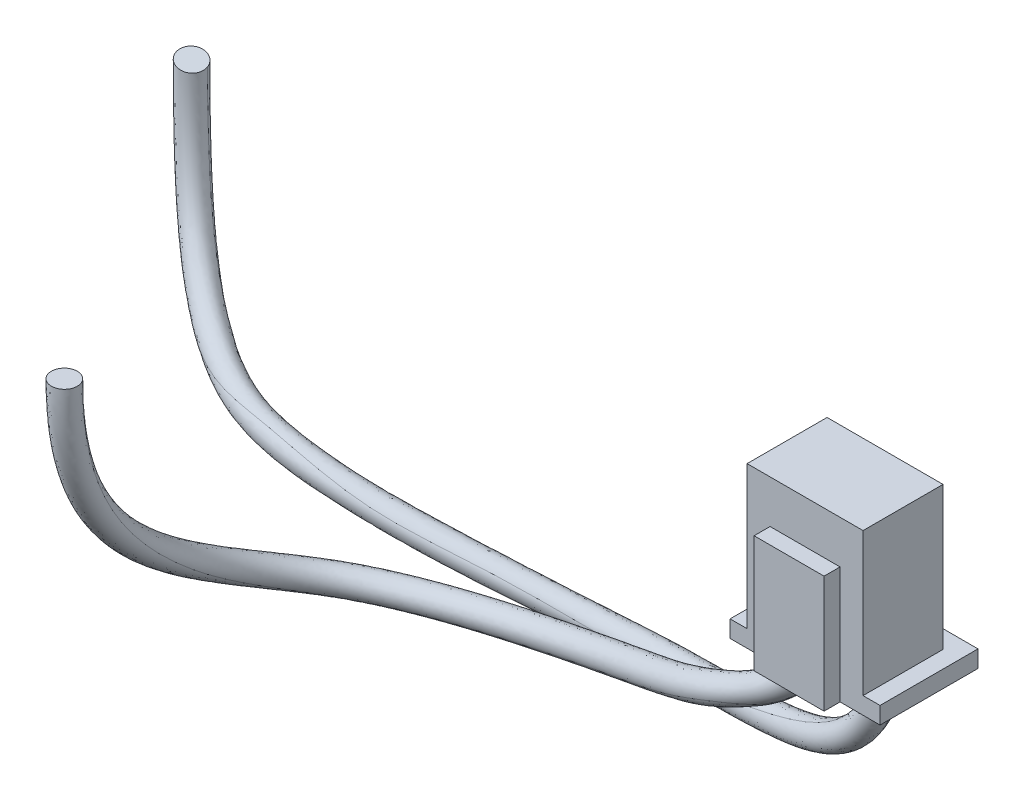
ISO-10303-21;
HEADER;
FILE_DESCRIPTION(('STEP AP214'),'2;1');
FILE_NAME('part.step','',(''),(''),'','','');
FILE_SCHEMA(('AUTOMOTIVE_DESIGN { 1 0 10303 214 1 1 1 1 }'));
ENDSEC;
DATA;
#1=APPLICATION_CONTEXT('core data for automotive mechanical design processes');
#2=APPLICATION_PROTOCOL_DEFINITION('international standard','automotive_design',2000,#1);
#3=PRODUCT_CONTEXT('',#1,'mechanical');
#4=PRODUCT('Part','Part','',(#3));
#5=PRODUCT_RELATED_PRODUCT_CATEGORY('part','',(#4));
#6=PRODUCT_DEFINITION_FORMATION('','',#4);
#7=PRODUCT_DEFINITION_CONTEXT('part definition',#1,'design');
#8=PRODUCT_DEFINITION('design','',#6,#7);
#9=PRODUCT_DEFINITION_SHAPE('','',#8);
#10=(LENGTH_UNIT() NAMED_UNIT(*) SI_UNIT(.MILLI.,.METRE.));
#11=(NAMED_UNIT(*) PLANE_ANGLE_UNIT() SI_UNIT($,.RADIAN.));
#12=(NAMED_UNIT(*) SI_UNIT($,.STERADIAN.) SOLID_ANGLE_UNIT());
#13=UNCERTAINTY_MEASURE_WITH_UNIT(LENGTH_MEASURE(1.E-05),#10,'distance_accuracy_value','');
#14=(GEOMETRIC_REPRESENTATION_CONTEXT(3) GLOBAL_UNCERTAINTY_ASSIGNED_CONTEXT((#13)) GLOBAL_UNIT_ASSIGNED_CONTEXT((#10,
#11,#12)) REPRESENTATION_CONTEXT('',''));
#15=CARTESIAN_POINT('',(0.,0.,0.));
#16=DIRECTION('',(0.,0.,1.));
#17=DIRECTION('',(1.,0.,0.));
#18=AXIS2_PLACEMENT_3D('',#15,#16,#17);
#19=CARTESIAN_POINT('',(5.8,0.,0.));
#20=DIRECTION('',(0.,0.,-1.));
#21=DIRECTION('',(-1.,0.,0.));
#22=AXIS2_PLACEMENT_3D('',#19,#20,#21);
#23=PLANE('',#22);
#24=DIRECTION('',(0.,1.,0.));
#25=VECTOR('',#24,1.);
#26=CARTESIAN_POINT('',(0.,3.575,0.));
#27=LINE('',#26,#25);
#28=CARTESIAN_POINT('',(-1.25000040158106E-09,0.,-9.50000034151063E-10));
#29=VERTEX_POINT('',#28);
#30=CARTESIAN_POINT('',(0.,7.15,0.));
#31=VERTEX_POINT('',#30);
#32=EDGE_CURVE('E122',#29,#31,#27,.T.);
#33=ORIENTED_EDGE('',*,*,#32,.T.);
#34=DIRECTION('',(1.,0.,0.));
#35=VECTOR('',#34,1.);
#36=CARTESIAN_POINT('',(2.9,7.15,0.));
#37=LINE('',#36,#35);
#38=CARTESIAN_POINT('',(5.8,7.15,0.));
#39=VERTEX_POINT('',#38);
#40=EDGE_CURVE('E146',#31,#39,#37,.T.);
#41=ORIENTED_EDGE('',*,*,#40,.T.);
#42=DIRECTION('',(0.,-1.,0.));
#43=VECTOR('',#42,1.);
#44=CARTESIAN_POINT('',(5.8,3.575,0.));
#45=LINE('',#44,#43);
#46=CARTESIAN_POINT('',(5.80000000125,0.,-9.50000034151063E-10));
#47=VERTEX_POINT('',#46);
#48=EDGE_CURVE('E128',#39,#47,#45,.T.);
#49=ORIENTED_EDGE('',*,*,#48,.T.);
#50=DIRECTION('',(1.,0.,0.));
#51=VECTOR('',#50,1.);
#52=CARTESIAN_POINT('',(2.9,0.,-1.90000001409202E-09));
#53=LINE('',#52,#51);
#54=EDGE_CURVE('E125',#29,#47,#53,.T.);
#55=ORIENTED_EDGE('',*,*,#54,.F.);
#56=EDGE_LOOP('',(#33,#41,#49,#55));
#57=FACE_BOUND('',#56,.T.);
#58=ADVANCED_FACE('F16',(#57),#23,.T.);
#59=CARTESIAN_POINT('',(6.65,0.,-0.9));
#60=DIRECTION('',(0.,1.,0.));
#61=DIRECTION('',(-1.,0.,0.));
#62=AXIS2_PLACEMENT_3D('',#59,#60,#61);
#63=PLANE('',#62);
#64=DIRECTION('',(0.,0.,-1.));
#65=VECTOR('',#64,1.);
#66=CARTESIAN_POINT('',(0.,0.,2.));
#67=LINE('',#66,#65);
#68=CARTESIAN_POINT('',(-1.87500052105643E-09,0.,4.));
#69=VERTEX_POINT('',#68);
#70=EDGE_CURVE('E132',#69,#29,#67,.T.);
#71=ORIENTED_EDGE('',*,*,#70,.T.);
#72=ORIENTED_EDGE('',*,*,#54,.T.);
#73=DIRECTION('',(0.,0.,1.));
#74=VECTOR('',#73,1.);
#75=CARTESIAN_POINT('',(5.8,0.,2.));
#76=LINE('',#75,#74);
#77=CARTESIAN_POINT('',(5.800000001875,0.,4.));
#78=VERTEX_POINT('',#77);
#79=EDGE_CURVE('E397',#47,#78,#76,.T.);
#80=ORIENTED_EDGE('',*,*,#79,.T.);
#81=DIRECTION('',(1.,0.,0.));
#82=VECTOR('',#81,1.);
#83=CARTESIAN_POINT('',(2.9,0.,4.));
#84=LINE('',#83,#82);
#85=CARTESIAN_POINT('',(6.65,0.,4.));
#86=VERTEX_POINT('',#85);
#87=EDGE_CURVE('E151',#78,#86,#84,.T.);
#88=ORIENTED_EDGE('',*,*,#87,.T.);
#89=DIRECTION('',(0.,0.,1.));
#90=VECTOR('',#89,1.);
#91=CARTESIAN_POINT('',(6.65,0.,1.55));
#92=LINE('',#91,#90);
#93=CARTESIAN_POINT('',(6.65,0.,-0.9));
#94=VERTEX_POINT('',#93);
#95=EDGE_CURVE('E374',#94,#86,#92,.T.);
#96=ORIENTED_EDGE('',*,*,#95,.F.);
#97=DIRECTION('',(1.,0.,0.));
#98=VECTOR('',#97,1.);
#99=CARTESIAN_POINT('',(2.9,0.,-0.9));
#100=LINE('',#99,#98);
#101=CARTESIAN_POINT('',(-0.85,0.,-0.9));
#102=VERTEX_POINT('',#101);
#103=EDGE_CURVE('E380',#102,#94,#100,.T.);
#104=ORIENTED_EDGE('',*,*,#103,.F.);
#105=DIRECTION('',(0.,0.,-1.));
#106=VECTOR('',#105,1.);
#107=CARTESIAN_POINT('',(-0.85,0.,1.55));
#108=LINE('',#107,#106);
#109=CARTESIAN_POINT('',(-0.85,0.,4.));
#110=VERTEX_POINT('',#109);
#111=EDGE_CURVE('E385',#110,#102,#108,.T.);
#112=ORIENTED_EDGE('',*,*,#111,.F.);
#113=DIRECTION('',(1.,0.,0.));
#114=VECTOR('',#113,1.);
#115=CARTESIAN_POINT('',(2.9,0.,4.));
#116=LINE('',#115,#114);
#117=EDGE_CURVE('E133',#110,#69,#116,.T.);
#118=ORIENTED_EDGE('',*,*,#117,.T.);
#119=EDGE_LOOP('',(#71,#72,#80,#88,#96,#104,#112,#118));
#120=FACE_BOUND('',#119,.T.);
#121=ADVANCED_FACE('F136',(#120),#63,.T.);
#122=CARTESIAN_POINT('',(0.,0.,4.));
#123=DIRECTION('',(1.,0.,0.));
#124=DIRECTION('',(0.,0.,-1.));
#125=AXIS2_PLACEMENT_3D('',#122,#123,#124);
#126=PLANE('',#125);
#127=ORIENTED_EDGE('',*,*,#70,.F.);
#128=DIRECTION('',(0.,1.,0.));
#129=VECTOR('',#128,1.);
#130=CARTESIAN_POINT('',(-2.50000074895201E-09,3.15,4.));
#131=LINE('',#130,#129);
#132=CARTESIAN_POINT('',(-6.25000173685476E-10,7.15,4.));
#133=VERTEX_POINT('',#132);
#134=EDGE_CURVE('E367',#69,#133,#131,.T.);
#135=ORIENTED_EDGE('',*,*,#134,.T.);
#136=DIRECTION('',(0.,0.,-1.));
#137=VECTOR('',#136,1.);
#138=CARTESIAN_POINT('',(0.,7.15,2.));
#139=LINE('',#138,#137);
#140=EDGE_CURVE('E143',#133,#31,#139,.T.);
#141=ORIENTED_EDGE('',*,*,#140,.T.);
#142=ORIENTED_EDGE('',*,*,#32,.F.);
#143=EDGE_LOOP('',(#127,#135,#141,#142));
#144=FACE_BOUND('',#143,.T.);
#145=ADVANCED_FACE('F141',(#144),#126,.F.);
#146=CARTESIAN_POINT('',(0.,7.15,4.));
#147=DIRECTION('',(0.,-1.,0.));
#148=DIRECTION('',(0.,0.,-1.));
#149=AXIS2_PLACEMENT_3D('',#146,#147,#148);
#150=PLANE('',#149);
#151=ORIENTED_EDGE('',*,*,#140,.F.);
#152=DIRECTION('',(1.,0.,0.));
#153=VECTOR('',#152,1.);
#154=CARTESIAN_POINT('',(2.9,7.15,4.));
#155=LINE('',#154,#153);
#156=CARTESIAN_POINT('',(5.800000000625,7.15,4.));
#157=VERTEX_POINT('',#156);
#158=EDGE_CURVE('E365',#133,#157,#155,.T.);
#159=ORIENTED_EDGE('',*,*,#158,.T.);
#160=DIRECTION('',(0.,0.,-1.));
#161=VECTOR('',#160,1.);
#162=CARTESIAN_POINT('',(5.8,7.15,2.));
#163=LINE('',#162,#161);
#164=EDGE_CURVE('E394',#157,#39,#163,.T.);
#165=ORIENTED_EDGE('',*,*,#164,.T.);
#166=ORIENTED_EDGE('',*,*,#40,.F.);
#167=EDGE_LOOP('',(#151,#159,#165,#166));
#168=FACE_BOUND('',#167,.T.);
#169=ADVANCED_FACE('F256',(#168),#150,.F.);
#170=CARTESIAN_POINT('',(5.8,0.,0.));
#171=DIRECTION('',(-1.,0.,0.));
#172=DIRECTION('',(0.,0.,1.));
#173=AXIS2_PLACEMENT_3D('',#170,#171,#172);
#174=PLANE('',#173);
#175=ORIENTED_EDGE('',*,*,#164,.F.);
#176=DIRECTION('',(0.,-1.,0.));
#177=VECTOR('',#176,1.);
#178=CARTESIAN_POINT('',(5.8000000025,3.15,4.));
#179=LINE('',#178,#177);
#180=EDGE_CURVE('E362',#157,#78,#179,.T.);
#181=ORIENTED_EDGE('',*,*,#180,.T.);
#182=ORIENTED_EDGE('',*,*,#79,.F.);
#183=ORIENTED_EDGE('',*,*,#48,.F.);
#184=EDGE_LOOP('',(#175,#181,#182,#183));
#185=FACE_BOUND('',#184,.T.);
#186=ADVANCED_FACE('F259',(#185),#174,.F.);
#187=CARTESIAN_POINT('',(4.65,5.,4.));
#188=DIRECTION('',(-1.,0.,0.));
#189=DIRECTION('',(0.,-1.,0.));
#190=AXIS2_PLACEMENT_3D('',#187,#188,#189);
#191=PLANE('',#190);
#192=DIRECTION('',(0.,0.,1.));
#193=VECTOR('',#192,1.);
#194=CARTESIAN_POINT('',(4.65,-0.85,4.4));
#195=LINE('',#194,#193);
#196=CARTESIAN_POINT('',(4.64999999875,-0.85,4.000000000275));
#197=VERTEX_POINT('',#196);
#198=CARTESIAN_POINT('',(4.649999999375,-0.85,4.8));
#199=VERTEX_POINT('',#198);
#200=EDGE_CURVE('E322',#197,#199,#195,.T.);
#201=ORIENTED_EDGE('',*,*,#200,.F.);
#202=DIRECTION('',(0.,1.,0.));
#203=VECTOR('',#202,1.);
#204=CARTESIAN_POINT('',(4.6499999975,3.15,4.));
#205=LINE('',#204,#203);
#206=CARTESIAN_POINT('',(4.649999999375,5.,4.));
#207=VERTEX_POINT('',#206);
#208=EDGE_CURVE('E357',#197,#207,#205,.T.);
#209=ORIENTED_EDGE('',*,*,#208,.T.);
#210=DIRECTION('',(0.,0.,1.));
#211=VECTOR('',#210,1.);
#212=CARTESIAN_POINT('',(4.65,5.,4.4));
#213=LINE('',#212,#211);
#214=CARTESIAN_POINT('',(4.65,5.,4.8));
#215=VERTEX_POINT('',#214);
#216=EDGE_CURVE('E390',#207,#215,#213,.T.);
#217=ORIENTED_EDGE('',*,*,#216,.T.);
#218=DIRECTION('',(0.,-1.,0.));
#219=VECTOR('',#218,1.);
#220=CARTESIAN_POINT('',(4.65,2.075,4.8));
#221=LINE('',#220,#219);
#222=EDGE_CURVE('E312',#215,#199,#221,.T.);
#223=ORIENTED_EDGE('',*,*,#222,.T.);
#224=EDGE_LOOP('',(#201,#209,#217,#223));
#225=FACE_BOUND('',#224,.T.);
#226=ADVANCED_FACE('F263',(#225),#191,.F.);
#227=CARTESIAN_POINT('',(1.15,5.,4.8));
#228=DIRECTION('',(0.,-1.,0.));
#229=DIRECTION('',(0.,0.,-1.));
#230=AXIS2_PLACEMENT_3D('',#227,#228,#229);
#231=PLANE('',#230);
#232=DIRECTION('',(-1.,0.,0.));
#233=VECTOR('',#232,1.);
#234=CARTESIAN_POINT('',(2.9,5.,4.));
#235=LINE('',#234,#233);
#236=CARTESIAN_POINT('',(1.150000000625,5.,4.));
#237=VERTEX_POINT('',#236);
#238=EDGE_CURVE('E75',#207,#237,#235,.T.);
#239=ORIENTED_EDGE('',*,*,#238,.T.);
#240=DIRECTION('',(0.,0.,1.));
#241=VECTOR('',#240,1.);
#242=CARTESIAN_POINT('',(1.15,5.,4.4));
#243=LINE('',#242,#241);
#244=CARTESIAN_POINT('',(1.15,5.,4.8));
#245=VERTEX_POINT('',#244);
#246=EDGE_CURVE('E387',#237,#245,#243,.T.);
#247=ORIENTED_EDGE('',*,*,#246,.T.);
#248=DIRECTION('',(1.,0.,0.));
#249=VECTOR('',#248,1.);
#250=CARTESIAN_POINT('',(2.9,5.,4.8));
#251=LINE('',#250,#249);
#252=EDGE_CURVE('E309',#245,#215,#251,.T.);
#253=ORIENTED_EDGE('',*,*,#252,.T.);
#254=ORIENTED_EDGE('',*,*,#216,.F.);
#255=EDGE_LOOP('',(#239,#247,#253,#254));
#256=FACE_BOUND('',#255,.T.);
#257=ADVANCED_FACE('F267',(#256),#231,.F.);
#258=CARTESIAN_POINT('',(1.15,-0.85,4.));
#259=DIRECTION('',(1.,0.,0.));
#260=DIRECTION('',(0.,1.,0.));
#261=AXIS2_PLACEMENT_3D('',#258,#259,#260);
#262=PLANE('',#261);
#263=DIRECTION('',(0.,-1.,0.));
#264=VECTOR('',#263,1.);
#265=CARTESIAN_POINT('',(1.1500000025,3.15,4.));
#266=LINE('',#265,#264);
#267=CARTESIAN_POINT('',(1.15000000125,-0.85,4.000000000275));
#268=VERTEX_POINT('',#267);
#269=EDGE_CURVE('E351',#237,#268,#266,.T.);
#270=ORIENTED_EDGE('',*,*,#269,.T.);
#271=DIRECTION('',(0.,0.,-1.));
#272=VECTOR('',#271,1.);
#273=CARTESIAN_POINT('',(1.15,-0.85,4.4));
#274=LINE('',#273,#272);
#275=CARTESIAN_POINT('',(1.150000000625,-0.85,4.8));
#276=VERTEX_POINT('',#275);
#277=EDGE_CURVE('E318',#276,#268,#274,.T.);
#278=ORIENTED_EDGE('',*,*,#277,.F.);
#279=DIRECTION('',(0.,1.,0.));
#280=VECTOR('',#279,1.);
#281=CARTESIAN_POINT('',(1.15,2.075,4.8));
#282=LINE('',#281,#280);
#283=EDGE_CURVE('E303',#276,#245,#282,.T.);
#284=ORIENTED_EDGE('',*,*,#283,.T.);
#285=ORIENTED_EDGE('',*,*,#246,.F.);
#286=EDGE_LOOP('',(#270,#278,#284,#285));
#287=FACE_BOUND('',#286,.T.);
#288=ADVANCED_FACE('F271',(#287),#262,.F.);
#289=CARTESIAN_POINT('',(-22.7591785,5.801423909,16.706348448));
#290=DIRECTION('',(0.,-1.,0.));
#291=DIRECTION('',(0.,0.,-1.));
#292=AXIS2_PLACEMENT_3D('',#289,#290,#291);
#293=PLANE('',#292);
#294=CARTESIAN_POINT('',(-22.6163984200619,5.801423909,16.4451017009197));
#295=CARTESIAN_POINT('',(-22.6387318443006,5.801423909,16.4161472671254));
#296=CARTESIAN_POINT('',(-22.6585669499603,5.801423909,16.3852808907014));
#297=CARTESIAN_POINT('',(-22.6927863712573,5.801423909,16.3206891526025));
#298=CARTESIAN_POINT('',(-22.7071746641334,5.801423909,16.2869658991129));
#299=CARTESIAN_POINT('',(-22.730085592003,5.801423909,16.2175640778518));
#300=CARTESIAN_POINT('',(-22.7386055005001,5.801423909,16.1818846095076));
#301=CARTESIAN_POINT('',(-22.749534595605,5.801423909,16.1096095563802));
#302=CARTESIAN_POINT('',(-22.7519449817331,5.801423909,16.0730141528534));
#303=CARTESIAN_POINT('',(-22.7505877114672,5.801423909,15.9999342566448));
#304=CARTESIAN_POINT('',(-22.7468194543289,5.801423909,15.9634497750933));
#305=CARTESIAN_POINT('',(-22.7332113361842,5.801423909,15.8916312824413));
#306=CARTESIAN_POINT('',(-22.7233714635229,5.801423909,15.8562972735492));
#307=CARTESIAN_POINT('',(-22.6978988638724,5.801423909,15.7877816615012));
#308=CARTESIAN_POINT('',(-22.6822659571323,5.801423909,15.7546001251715));
#309=CARTESIAN_POINT('',(-22.6456523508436,5.801423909,15.6913347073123));
#310=CARTESIAN_POINT('',(-22.624671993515,5.801423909,15.6612506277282));
#311=CARTESIAN_POINT('',(-22.5779580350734,5.801423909,15.6050310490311));
#312=CARTESIAN_POINT('',(-22.5522243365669,5.801423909,15.5788956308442));
#313=CARTESIAN_POINT('',(-22.4967338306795,5.801423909,15.5313154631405));
#314=CARTESIAN_POINT('',(-22.4669769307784,5.801423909,15.5098708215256));
#315=CARTESIAN_POINT('',(-22.4042855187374,5.801423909,15.4722819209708));
#316=CARTESIAN_POINT('',(-22.3713510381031,5.801423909,15.4561376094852));
#317=CARTESIAN_POINT('',(-22.3032392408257,5.801423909,15.4296074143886));
#318=CARTESIAN_POINT('',(-22.2680619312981,5.801423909,15.4192215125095));
#319=CARTESIAN_POINT('',(-22.1964620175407,5.801423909,15.4045026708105));
#320=CARTESIAN_POINT('',(-22.1600393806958,5.801423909,15.400169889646));
#321=CARTESIAN_POINT('',(-22.0869854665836,5.801423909,15.3976809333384));
#322=CARTESIAN_POINT('',(-22.0503541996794,5.801423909,15.3995244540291));
#323=CARTESIAN_POINT('',(-21.977920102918,5.801423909,15.4093349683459));
#324=CARTESIAN_POINT('',(-21.9421172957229,5.801423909,15.4173021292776));
#325=CARTESIAN_POINT('',(-21.8723574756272,5.801423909,15.4391348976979));
#326=CARTESIAN_POINT('',(-21.8384004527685,5.801423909,15.4530004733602));
#327=CARTESIAN_POINT('',(-21.7732716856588,5.801423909,15.4862455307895));
#328=CARTESIAN_POINT('',(-21.7421021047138,5.801423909,15.5056292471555));
#329=CARTESIAN_POINT('',(-21.6835053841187,5.801423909,15.5493358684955));
#330=CARTESIAN_POINT('',(-21.6560725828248,5.801423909,15.5736511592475));
#331=CARTESIAN_POINT('',(-21.6151317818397,5.801423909,15.6165879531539));
#332=CARTESIAN_POINT('',(-21.6002596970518,5.801423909,15.6339253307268));
#333=CARTESIAN_POINT('',(-21.5863585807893,5.801423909,15.6519951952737));
#334=B_SPLINE_CURVE_WITH_KNOTS('',3,(#294,#295,#296,#297,#298,#299,#300,#301,#302,#303,#304,
#305,#306,#307,#308,#309,#310,#311,#312,#313,#314,#315,#316,#317,#318,#319,#320,#321,#322,#323,
#324,#325,#326,#327,#328,#329,#330,#331,#332,#333),.UNSPECIFIED.,.F.,.F.,(4,2,2,2,2,2,2,2,2,2,2,
2,2,2,2,2,2,2,2,4),(0.,0.109555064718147,0.219029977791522,0.328555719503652,0.438059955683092,
0.547574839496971,0.657089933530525,0.766608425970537,0.876119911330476,0.985633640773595,
1.09514988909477,1.20466505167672,1.3141798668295,1.4236975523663,1.53320984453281,
1.64272512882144,1.75223982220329,1.86183878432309,1.97126979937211,2.03966454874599),.UNSPECIFIED.);
#335=CARTESIAN_POINT('',(-22.6163984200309,5.801423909,16.4451017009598));
#336=VERTEX_POINT('',#335);
#337=CARTESIAN_POINT('',(-21.5863585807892,5.801423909,15.6519951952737));
#338=VERTEX_POINT('',#337);
#339=EDGE_CURVE('E21',#336,#338,#334,.T.);
#340=ORIENTED_EDGE('',*,*,#339,.F.);
#341=CARTESIAN_POINT('',(-21.5863585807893,5.801423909,15.6519951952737));
#342=CARTESIAN_POINT('',(-21.5640251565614,5.801423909,15.6809496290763));
#343=CARTESIAN_POINT('',(-21.5441900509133,5.801423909,15.7118160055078));
#344=CARTESIAN_POINT('',(-21.5099706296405,5.801423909,15.7764077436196));
#345=CARTESIAN_POINT('',(-21.4955823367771,5.801423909,15.8101309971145));
#346=CARTESIAN_POINT('',(-21.4726714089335,5.801423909,15.8795328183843));
#347=CARTESIAN_POINT('',(-21.4641515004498,5.801423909,15.9152122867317));
#348=CARTESIAN_POINT('',(-21.4532224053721,5.801423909,15.9874873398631));
#349=CARTESIAN_POINT('',(-21.4508120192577,5.801423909,16.0240827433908));
#350=CARTESIAN_POINT('',(-21.4521692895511,5.801423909,16.097162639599));
#351=CARTESIAN_POINT('',(-21.455937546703,5.801423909,16.133647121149));
#352=CARTESIAN_POINT('',(-21.4695456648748,5.801423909,16.2054656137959));
#353=CARTESIAN_POINT('',(-21.4793855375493,5.801423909,16.2407996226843));
#354=CARTESIAN_POINT('',(-21.5048581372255,5.801423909,16.3093152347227));
#355=CARTESIAN_POINT('',(-21.520491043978,5.801423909,16.3424967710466));
#356=CARTESIAN_POINT('',(-21.5571046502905,5.801423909,16.405762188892));
#357=CARTESIAN_POINT('',(-21.5780850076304,5.801423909,16.4358462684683));
#358=CARTESIAN_POINT('',(-21.6247989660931,5.801423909,16.4920658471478));
#359=CARTESIAN_POINT('',(-21.6505326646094,5.801423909,16.518201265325));
#360=CARTESIAN_POINT('',(-21.7060231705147,5.801423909,16.5657814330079));
#361=CARTESIAN_POINT('',(-21.7357800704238,5.801423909,16.5872260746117));
#362=CARTESIAN_POINT('',(-21.7984714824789,5.801423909,16.624814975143));
#363=CARTESIAN_POINT('',(-21.8314059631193,5.801423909,16.6409592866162));
#364=CARTESIAN_POINT('',(-21.8995177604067,5.801423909,16.6674894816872));
#365=CARTESIAN_POINT('',(-21.9346950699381,5.801423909,16.6778753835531));
#366=CARTESIAN_POINT('',(-22.0062949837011,5.801423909,16.6925942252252));
#367=CARTESIAN_POINT('',(-22.0427176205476,5.801423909,16.696927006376));
#368=CARTESIAN_POINT('',(-22.1157715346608,5.801423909,16.6994159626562));
#369=CARTESIAN_POINT('',(-22.1524028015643,5.801423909,16.6975724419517));
#370=CARTESIAN_POINT('',(-22.224836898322,5.801423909,16.6877619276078));
#371=CARTESIAN_POINT('',(-22.2606397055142,5.801423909,16.6797947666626));
#372=CARTESIAN_POINT('',(-22.3303995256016,5.801423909,16.6579619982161));
#373=CARTESIAN_POINT('',(-22.3643565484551,5.801423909,16.644096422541));
#374=CARTESIAN_POINT('',(-22.4294853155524,5.801423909,16.6108513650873));
#375=CARTESIAN_POINT('',(-22.4606548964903,5.801423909,16.5914676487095));
#376=CARTESIAN_POINT('',(-22.519251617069,5.801423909,16.5477610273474));
#377=CARTESIAN_POINT('',(-22.5466844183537,5.801423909,16.5234457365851));
#378=CARTESIAN_POINT('',(-22.5876252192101,5.801423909,16.4805089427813));
#379=CARTESIAN_POINT('',(-22.6024973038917,5.801423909,16.4631715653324));
#380=CARTESIAN_POINT('',(-22.6163984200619,5.801423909,16.4451017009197));
#381=B_SPLINE_CURVE_WITH_KNOTS('',3,(#341,#342,#343,#344,#345,#346,#347,#348,#349,#350,#351,
#352,#353,#354,#355,#356,#357,#358,#359,#360,#361,#362,#363,#364,#365,#366,#367,#368,#369,#370,
#371,#372,#373,#374,#375,#376,#377,#378,#379,#380),.UNSPECIFIED.,.F.,.F.,(4,2,2,2,2,2,2,2,2,2,2,
2,2,2,2,2,2,2,2,4),(0.,0.109555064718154,0.219029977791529,0.32855571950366,0.438059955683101,
0.547574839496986,0.657089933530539,0.766608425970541,0.876119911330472,0.985633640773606,
1.09514988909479,1.20466505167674,1.31417986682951,1.42369755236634,1.53320984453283,
1.64272512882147,1.75223982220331,1.86183878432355,1.97126979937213,2.0396645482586),.UNSPECIFIED.);
#382=EDGE_CURVE('E232',#338,#336,#381,.T.);
#383=ORIENTED_EDGE('',*,*,#382,.F.);
#384=EDGE_LOOP('',(#340,#383));
#385=FACE_BOUND('',#384,.T.);
#386=ADVANCED_FACE('F273',(#385),#293,.F.);
#387=CARTESIAN_POINT('',(-0.85,0.,-0.9));
#388=DIRECTION('',(-1.,0.,0.));
#389=DIRECTION('',(0.,-1.,0.));
#390=AXIS2_PLACEMENT_3D('',#387,#388,#389);
#391=PLANE('',#390);
#392=DIRECTION('',(0.,0.,-1.));
#393=VECTOR('',#392,1.);
#394=CARTESIAN_POINT('',(-0.85,-0.85,1.95));
#395=LINE('',#394,#393);
#396=CARTESIAN_POINT('',(-0.85,-0.85,4.000000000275));
#397=VERTEX_POINT('',#396);
#398=CARTESIAN_POINT('',(-0.85,-0.85,-0.9));
#399=VERTEX_POINT('',#398);
#400=EDGE_CURVE('E335',#397,#399,#395,.T.);
#401=ORIENTED_EDGE('',*,*,#400,.F.);
#402=DIRECTION('',(0.,1.,0.));
#403=VECTOR('',#402,1.);
#404=CARTESIAN_POINT('',(-0.85,3.15,4.));
#405=LINE('',#404,#403);
#406=EDGE_CURVE('E369',#397,#110,#405,.T.);
#407=ORIENTED_EDGE('',*,*,#406,.T.);
#408=ORIENTED_EDGE('',*,*,#111,.T.);
#409=DIRECTION('',(0.,1.,0.));
#410=VECTOR('',#409,1.);
#411=CARTESIAN_POINT('',(-0.85,-0.425,-0.9));
#412=LINE('',#411,#410);
#413=EDGE_CURVE('E382',#399,#102,#412,.T.);
#414=ORIENTED_EDGE('',*,*,#413,.F.);
#415=EDGE_LOOP('',(#401,#407,#408,#414));
#416=FACE_BOUND('',#415,.T.);
#417=ADVANCED_FACE('F278',(#416),#391,.T.);
#418=CARTESIAN_POINT('',(6.65,-0.85,-0.9));
#419=DIRECTION('',(0.,0.,-1.));
#420=DIRECTION('',(-1.,0.,0.));
#421=AXIS2_PLACEMENT_3D('',#418,#419,#420);
#422=PLANE('',#421);
#423=DIRECTION('',(0.,1.,0.));
#424=VECTOR('',#423,1.);
#425=CARTESIAN_POINT('',(6.65,-0.425,-0.9));
#426=LINE('',#425,#424);
#427=CARTESIAN_POINT('',(6.65,-0.85,-0.9));
#428=VERTEX_POINT('',#427);
#429=EDGE_CURVE('E377',#428,#94,#426,.T.);
#430=ORIENTED_EDGE('',*,*,#429,.F.);
#431=DIRECTION('',(1.,0.,0.));
#432=VECTOR('',#431,1.);
#433=CARTESIAN_POINT('',(2.9,-0.85,-0.9));
#434=LINE('',#433,#432);
#435=EDGE_CURVE('E332',#399,#428,#434,.T.);
#436=ORIENTED_EDGE('',*,*,#435,.F.);
#437=ORIENTED_EDGE('',*,*,#413,.T.);
#438=ORIENTED_EDGE('',*,*,#103,.T.);
#439=EDGE_LOOP('',(#430,#436,#437,#438));
#440=FACE_BOUND('',#439,.T.);
#441=ADVANCED_FACE('F282',(#440),#422,.T.);
#442=CARTESIAN_POINT('',(6.65,-0.85,-0.9));
#443=DIRECTION('',(1.,0.,0.));
#444=DIRECTION('',(0.,1.,0.));
#445=AXIS2_PLACEMENT_3D('',#442,#443,#444);
#446=PLANE('',#445);
#447=ORIENTED_EDGE('',*,*,#95,.T.);
#448=DIRECTION('',(0.,-1.,0.));
#449=VECTOR('',#448,1.);
#450=CARTESIAN_POINT('',(6.65,3.15,4.));
#451=LINE('',#450,#449);
#452=CARTESIAN_POINT('',(6.65,-0.85,4.000000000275));
#453=VERTEX_POINT('',#452);
#454=EDGE_CURVE('E359',#86,#453,#451,.T.);
#455=ORIENTED_EDGE('',*,*,#454,.T.);
#456=DIRECTION('',(0.,0.,1.));
#457=VECTOR('',#456,1.);
#458=CARTESIAN_POINT('',(6.65,-0.85,1.95));
#459=LINE('',#458,#457);
#460=EDGE_CURVE('E327',#428,#453,#459,.T.);
#461=ORIENTED_EDGE('',*,*,#460,.F.);
#462=ORIENTED_EDGE('',*,*,#429,.T.);
#463=EDGE_LOOP('',(#447,#455,#461,#462));
#464=FACE_BOUND('',#463,.T.);
#465=ADVANCED_FACE('F286',(#464),#446,.T.);
#466=CARTESIAN_POINT('',(4.65,-0.85,4.8));
#467=DIRECTION('',(0.,0.,-1.));
#468=DIRECTION('',(-1.,0.,0.));
#469=AXIS2_PLACEMENT_3D('',#466,#467,#468);
#470=PLANE('',#469);
#471=ORIENTED_EDGE('',*,*,#283,.F.);
#472=DIRECTION('',(-1.,0.,0.));
#473=VECTOR('',#472,1.);
#474=CARTESIAN_POINT('',(2.9,-0.85,4.8));
#475=LINE('',#474,#473);
#476=EDGE_CURVE('E307',#199,#276,#475,.T.);
#477=ORIENTED_EDGE('',*,*,#476,.F.);
#478=ORIENTED_EDGE('',*,*,#222,.F.);
#479=ORIENTED_EDGE('',*,*,#252,.F.);
#480=EDGE_LOOP('',(#471,#477,#478,#479));
#481=FACE_BOUND('',#480,.T.);
#482=ADVANCED_FACE('F289',(#481),#470,.F.);
#483=CARTESIAN_POINT('',(6.65,-0.85,4.));
#484=DIRECTION('',(0.,0.,-1.));
#485=DIRECTION('',(-1.,0.,0.));
#486=AXIS2_PLACEMENT_3D('',#483,#484,#485);
#487=PLANE('',#486);
#488=ORIENTED_EDGE('',*,*,#269,.F.);
#489=ORIENTED_EDGE('',*,*,#238,.F.);
#490=ORIENTED_EDGE('',*,*,#208,.F.);
#491=DIRECTION('',(-1.,0.,0.));
#492=VECTOR('',#491,1.);
#493=CARTESIAN_POINT('',(2.9,-0.85,4.0000000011));
#494=LINE('',#493,#492);
#495=EDGE_CURVE('E324',#453,#197,#494,.T.);
#496=ORIENTED_EDGE('',*,*,#495,.F.);
#497=ORIENTED_EDGE('',*,*,#454,.F.);
#498=ORIENTED_EDGE('',*,*,#87,.F.);
#499=ORIENTED_EDGE('',*,*,#180,.F.);
#500=ORIENTED_EDGE('',*,*,#158,.F.);
#501=ORIENTED_EDGE('',*,*,#134,.F.);
#502=ORIENTED_EDGE('',*,*,#117,.F.);
#503=ORIENTED_EDGE('',*,*,#406,.F.);
#504=DIRECTION('',(-1.,0.,0.));
#505=VECTOR('',#504,1.);
#506=CARTESIAN_POINT('',(2.9,-0.85,4.0000000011));
#507=LINE('',#506,#505);
#508=EDGE_CURVE('E231',#268,#397,#507,.T.);
#509=ORIENTED_EDGE('',*,*,#508,.F.);
#510=EDGE_LOOP('',(#488,#489,#490,#496,#497,#498,#499,#500,#501,#502,#503,#509));
#511=FACE_BOUND('',#510,.T.);
#512=ADVANCED_FACE('F220',(#511),#487,.F.);
#513=CARTESIAN_POINT('',(1.8,-0.85,1.55));
#514=CARTESIAN_POINT('',(1.796787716,-1.128808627,1.560580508));
#515=CARTESIAN_POINT('',(1.74020943,-1.664107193,1.600850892));
#516=CARTESIAN_POINT('',(1.474942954,-2.391832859,1.726452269));
#517=CARTESIAN_POINT('',(1.069395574,-3.02646044,1.8965033));
#518=CARTESIAN_POINT('',(0.373137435,-3.746316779,2.165737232));
#519=CARTESIAN_POINT('',(-0.723768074,-4.46929414,2.558586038));
#520=CARTESIAN_POINT('',(-2.429719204,-4.874718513,3.020091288));
#521=CARTESIAN_POINT('',(-4.187866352,-5.552462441,3.065809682));
#522=CARTESIAN_POINT('',(-5.761914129,-6.200654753,2.808631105));
#523=CARTESIAN_POINT('',(-7.502528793,-6.744747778,2.551483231));
#524=CARTESIAN_POINT('',(-9.363722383,-7.170820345,2.418002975));
#525=CARTESIAN_POINT('',(-11.446968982,-7.653428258,2.35936466));
#526=CARTESIAN_POINT('',(-13.376865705,-7.96843315,2.48460185));
#527=CARTESIAN_POINT('',(-15.133557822,-8.16042458,2.772494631));
#528=CARTESIAN_POINT('',(-16.702643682,-8.227162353,3.227720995));
#529=CARTESIAN_POINT('',(-18.063471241,-8.172799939,3.850485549));
#530=CARTESIAN_POINT('',(-18.938584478,-8.061514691,4.439448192));
#531=CARTESIAN_POINT('',(-19.754952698,-7.851089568,5.192621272));
#532=CARTESIAN_POINT('',(-20.529152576,-7.481263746,6.240349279));
#533=CARTESIAN_POINT('',(-21.221155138,-6.70223271,7.925378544));
#534=CARTESIAN_POINT('',(-21.588515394,-5.50523348,9.786459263));
#535=CARTESIAN_POINT('',(-21.736445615,-4.068674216,11.449277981));
#536=CARTESIAN_POINT('',(-21.771187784,-2.498896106,12.869099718));
#537=CARTESIAN_POINT('',(-21.735344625,-0.836904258,14.017036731));
#538=CARTESIAN_POINT('',(-21.662814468,1.069412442,14.928295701));
#539=CARTESIAN_POINT('',(-21.593797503,3.252918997,15.524433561));
#540=CARTESIAN_POINT('',(-21.578057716,4.914184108,15.663820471));
#541=CARTESIAN_POINT('',(-21.586358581,5.801423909,15.651995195));
#542=CARTESIAN_POINT('',(1.8,-0.85,2.85));
#543=CARTESIAN_POINT('',(1.78035779,-1.090745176,2.859491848));
#544=CARTESIAN_POINT('',(1.690919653,-1.54991684,2.897584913));
#545=CARTESIAN_POINT('',(1.398752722,-2.151778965,3.003518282));
#546=CARTESIAN_POINT('',(0.967565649,-2.66514787,3.14466701));
#547=CARTESIAN_POINT('',(0.221863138,-3.218162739,3.344270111));
#548=CARTESIAN_POINT('',(-1.000685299,-3.685943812,3.647360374));
#549=CARTESIAN_POINT('',(-2.894026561,-3.670792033,3.362746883));
#550=CARTESIAN_POINT('',(-4.661817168,-4.370797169,3.458251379));
#551=CARTESIAN_POINT('',(-6.175648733,-5.151492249,3.455396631));
#552=CARTESIAN_POINT('',(-7.860325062,-5.710702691,3.256791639));
#553=CARTESIAN_POINT('',(-9.660720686,-6.058007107,3.025996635));
#554=CARTESIAN_POINT('',(-11.629852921,-6.572301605,3.062459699));
#555=CARTESIAN_POINT('',(-13.432390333,-6.888630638,3.210526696));
#556=CARTESIAN_POINT('',(-15.037083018,-7.094256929,3.516463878));
#557=CARTESIAN_POINT('',(-16.427460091,-7.181663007,3.957798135));
#558=CARTESIAN_POINT('',(-17.593020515,-7.152771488,4.518488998));
#559=CARTESIAN_POINT('',(-18.294622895,-7.099095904,5.039231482));
#560=CARTESIAN_POINT('',(-18.976100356,-6.90276445,5.634000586));
#561=CARTESIAN_POINT('',(-19.667953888,-6.492208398,6.396031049));
#562=CARTESIAN_POINT('',(-20.449342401,-5.649164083,7.692467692));
#563=CARTESIAN_POINT('',(-21.148761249,-4.403734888,9.173871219));
#564=CARTESIAN_POINT('',(-21.707361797,-3.048424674,10.609048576));
#565=CARTESIAN_POINT('',(-22.046266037,-1.641478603,11.915409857));
#566=CARTESIAN_POINT('',(-22.213382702,-0.168373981,12.9977731));
#567=CARTESIAN_POINT('',(-22.284290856,1.522712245,13.870343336));
#568=CARTESIAN_POINT('',(-22.319371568,3.47402995,14.457111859));
#569=CARTESIAN_POINT('',(-22.348653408,4.987887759,14.621353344));
#570=CARTESIAN_POINT('',(-22.379465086,5.801423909,14.621955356));
#571=CARTESIAN_POINT('',(0.5,-0.85,2.85));
#572=CARTESIAN_POINT('',(0.486782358,-0.994232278,2.838330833));
#573=CARTESIAN_POINT('',(0.410193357,-1.260378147,2.834101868));
#574=CARTESIAN_POINT('',(0.222970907,-1.600330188,2.836485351));
#575=CARTESIAN_POINT('',(-0.072042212,-1.926265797,2.851178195));
#576=CARTESIAN_POINT('',(-0.623172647,-2.347833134,2.852724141));
#577=CARTESIAN_POINT('',(-1.643696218,-2.781174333,2.838956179));
#578=CARTESIAN_POINT('',(-3.125758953,-3.39204452,2.072412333));
#579=CARTESIAN_POINT('',(-4.73519218,-3.978124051,2.189601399));
#580=CARTESIAN_POINT('',(-6.228619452,-4.484827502,2.340283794));
#581=CARTESIAN_POINT('',(-7.914994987,-4.988147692,2.172892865));
#582=CARTESIAN_POINT('',(-9.746061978,-5.455308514,1.876074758));
#583=CARTESIAN_POINT('',(-11.782673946,-5.887068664,1.966725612));
#584=CARTESIAN_POINT('',(-13.648407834,-6.182716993,2.139734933));
#585=CARTESIAN_POINT('',(-15.323883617,-6.35313515,2.486167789));
#586=CARTESIAN_POINT('',(-16.788962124,-6.407118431,2.976623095));
#587=CARTESIAN_POINT('',(-18.041974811,-6.350114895,3.597079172));
#588=CARTESIAN_POINT('',(-18.78998185,-6.244999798,4.19180942));
#589=CARTESIAN_POINT('',(-19.567803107,-6.054978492,4.84382899));
#590=CARTESIAN_POINT('',(-20.428010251,-5.729116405,5.650146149));
#591=CARTESIAN_POINT('',(-21.4502505,-5.064404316,7.060345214));
#592=CARTESIAN_POINT('',(-22.390183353,-4.135146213,8.777907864));
#593=CARTESIAN_POINT('',(-23.023912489,-3.074472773,10.539217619));
#594=CARTESIAN_POINT('',(-23.324608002,-1.819867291,12.129899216));
#595=CARTESIAN_POINT('',(-23.425493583,-0.388266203,13.429163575));
#596=CARTESIAN_POINT('',(-23.426966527,1.33627628,14.469272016));
#597=CARTESIAN_POINT('',(-23.399216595,3.368839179,15.179266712));
#598=CARTESIAN_POINT('',(-23.395294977,4.952824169,15.390809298));
#599=CARTESIAN_POINT('',(-23.409504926,5.801423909,15.415061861));
#600=CARTESIAN_POINT('',(0.5,-0.85,1.55));
#601=CARTESIAN_POINT('',(0.503212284,-1.03229573,1.539419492));
#602=CARTESIAN_POINT('',(0.459483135,-1.3745685,1.537367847));
#603=CARTESIAN_POINT('',(0.299161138,-1.840384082,1.559419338));
#604=CARTESIAN_POINT('',(0.029787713,-2.287578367,1.603014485));
#605=CARTESIAN_POINT('',(-0.47189835,-2.875987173,1.674191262));
#606=CARTESIAN_POINT('',(-1.366778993,-3.564524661,1.750181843));
#607=CARTESIAN_POINT('',(-2.661451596,-4.595971,1.729756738));
#608=CARTESIAN_POINT('',(-4.261241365,-5.159789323,1.797159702));
#609=CARTESIAN_POINT('',(-5.814884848,-5.533990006,1.693518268));
#610=CARTESIAN_POINT('',(-7.557198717,-6.022192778,1.467584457));
#611=CARTESIAN_POINT('',(-9.449063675,-6.568121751,1.268081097));
#612=CARTESIAN_POINT('',(-11.599790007,-6.968195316,1.263630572));
#613=CARTESIAN_POINT('',(-13.592883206,-7.262519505,1.413810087));
#614=CARTESIAN_POINT('',(-15.420358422,-7.419302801,1.742198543));
#615=CARTESIAN_POINT('',(-17.064145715,-7.452617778,2.246545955));
#616=CARTESIAN_POINT('',(-18.512425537,-7.370143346,2.929075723));
#617=CARTESIAN_POINT('',(-19.433943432,-7.207418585,3.592026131));
#618=CARTESIAN_POINT('',(-20.346655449,-7.00330361,4.402449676));
#619=CARTESIAN_POINT('',(-21.289208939,-6.718171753,5.494464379));
#620=CARTESIAN_POINT('',(-22.222063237,-6.117472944,7.293256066));
#621=CARTESIAN_POINT('',(-22.829937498,-5.236644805,9.390495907));
#622=CARTESIAN_POINT('',(-23.052996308,-4.094722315,11.379447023));
#623=CARTESIAN_POINT('',(-23.049529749,-2.677284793,13.083589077));
#624=CARTESIAN_POINT('',(-22.947455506,-1.05679648,14.448427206));
#625=CARTESIAN_POINT('',(-22.805490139,0.882976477,15.527224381));
#626=CARTESIAN_POINT('',(-22.673642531,3.147728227,16.246588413));
#627=CARTESIAN_POINT('',(-22.624699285,4.879120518,16.433276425));
#628=CARTESIAN_POINT('',(-22.61639842,5.801423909,16.445101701));
#629=(BOUNDED_SURFACE() B_SPLINE_SURFACE(3,3,((#513,#514,#515,#516,#517,#518,#519,#520,#521,
#522,#523,#524,#525,#526,#527,#528,#529,#530,#531,#532,#533,#534,#535,#536,#537,#538,#539,#540,
#541),(#542,#543,#544,#545,#546,#547,#548,#549,#550,#551,#552,#553,#554,#555,#556,#557,#558,
#559,#560,#561,#562,#563,#564,#565,#566,#567,#568,#569,#570),(#571,#572,#573,#574,#575,#576,
#577,#578,#579,#580,#581,#582,#583,#584,#585,#586,#587,#588,#589,#590,#591,#592,#593,#594,#595,
#596,#597,#598,#599),(#600,#601,#602,#603,#604,#605,#606,#607,#608,#609,#610,#611,#612,#613,
#614,#615,#616,#617,#618,#619,#620,#621,#622,#623,#624,#625,#626,#627,#628)),.UNSPECIFIED.,.F.,
.F.,.F.) B_SPLINE_SURFACE_WITH_KNOTS((4,4),(4,1,1,1,1,1,1,1,1,1,1,1,1,1,1,1,1,1,1,1,1,1,1,1,1,1,
4),(0.,0.5),(0.,0.0156249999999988,0.03125,0.046875,0.0625000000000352,0.09375,0.12500000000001,
0.157065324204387,0.1875,0.208196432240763,0.25,0.291666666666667,0.333333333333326,0.375,
0.416666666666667,0.458333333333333,0.5,0.511311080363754,0.5625,0.625,0.6875,0.75,0.8,0.85,0.9,
0.950000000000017,1.),
.UNSPECIFIED.) GEOMETRIC_REPRESENTATION_ITEM() RATIONAL_B_SPLINE_SURFACE(((1.,1.,1.,1.,1.,1.,1.,
1.,1.,1.,1.,1.,1.,1.,1.,1.,1.,1.,1.,1.,1.,1.,1.,1.,1.,1.,1.,1.,1.),(0.333333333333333,
0.333333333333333,0.333333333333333,0.333333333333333,0.333333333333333,0.333333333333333,
0.333333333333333,0.333333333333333,0.333333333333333,0.333333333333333,0.333333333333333,
0.333333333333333,0.333333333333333,0.333333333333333,0.333333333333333,0.333333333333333,
0.333333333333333,0.333333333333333,0.333333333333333,0.333333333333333,0.333333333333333,
0.333333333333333,0.333333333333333,0.333333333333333,0.333333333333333,0.333333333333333,
0.333333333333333,0.333333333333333,0.333333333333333),(0.333333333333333,0.333333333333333,
0.333333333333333,0.333333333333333,0.333333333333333,0.333333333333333,0.333333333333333,
0.333333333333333,0.333333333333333,0.333333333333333,0.333333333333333,0.333333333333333,
0.333333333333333,0.333333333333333,0.333333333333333,0.333333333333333,0.333333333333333,
0.333333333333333,0.333333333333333,0.333333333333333,0.333333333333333,0.333333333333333,
0.333333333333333,0.333333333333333,0.333333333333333,0.333333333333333,0.333333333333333,
0.333333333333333,0.333333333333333),(1.,1.,1.,1.,1.,1.,1.,1.,1.,1.,1.,1.,1.,1.,1.,1.,1.,1.,1.,
1.,1.,1.,1.,1.,1.,1.,1.,1.,1.))) REPRESENTATION_ITEM('') SURFACE());
#630=CARTESIAN_POINT('',(1.8,-0.85,1.55));
#631=CARTESIAN_POINT('',(1.796787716,-1.128808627,1.560580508));
#632=CARTESIAN_POINT('',(1.74020943,-1.664107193,1.600850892));
#633=CARTESIAN_POINT('',(1.474942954,-2.391832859,1.726452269));
#634=CARTESIAN_POINT('',(1.069395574,-3.02646044,1.8965033));
#635=CARTESIAN_POINT('',(0.373137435,-3.746316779,2.165737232));
#636=CARTESIAN_POINT('',(-0.723768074,-4.46929414,2.558586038));
#637=CARTESIAN_POINT('',(-2.429719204,-4.874718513,3.020091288));
#638=CARTESIAN_POINT('',(-4.187866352,-5.552462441,3.065809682));
#639=CARTESIAN_POINT('',(-5.761914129,-6.200654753,2.808631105));
#640=CARTESIAN_POINT('',(-7.502528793,-6.744747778,2.551483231));
#641=CARTESIAN_POINT('',(-9.363722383,-7.170820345,2.418002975));
#642=CARTESIAN_POINT('',(-11.446968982,-7.653428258,2.35936466));
#643=CARTESIAN_POINT('',(-13.376865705,-7.96843315,2.48460185));
#644=CARTESIAN_POINT('',(-15.133557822,-8.16042458,2.772494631));
#645=CARTESIAN_POINT('',(-16.702643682,-8.227162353,3.227720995));
#646=CARTESIAN_POINT('',(-18.063471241,-8.172799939,3.850485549));
#647=CARTESIAN_POINT('',(-18.938584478,-8.061514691,4.439448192));
#648=CARTESIAN_POINT('',(-19.754952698,-7.851089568,5.192621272));
#649=CARTESIAN_POINT('',(-20.529152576,-7.481263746,6.240349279));
#650=CARTESIAN_POINT('',(-21.221155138,-6.70223271,7.925378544));
#651=CARTESIAN_POINT('',(-21.588515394,-5.50523348,9.786459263));
#652=CARTESIAN_POINT('',(-21.736445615,-4.068674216,11.449277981));
#653=CARTESIAN_POINT('',(-21.771187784,-2.498896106,12.869099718));
#654=CARTESIAN_POINT('',(-21.735344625,-0.836904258,14.017036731));
#655=CARTESIAN_POINT('',(-21.662814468,1.069412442,14.928295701));
#656=CARTESIAN_POINT('',(-21.593797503,3.252918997,15.524433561));
#657=CARTESIAN_POINT('',(-21.578057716,4.914184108,15.663820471));
#658=CARTESIAN_POINT('',(-21.586358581,5.801423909,15.651995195));
#659=B_SPLINE_CURVE_WITH_KNOTS('',3,(#630,#631,#632,#633,#634,#635,#636,#637,#638,#639,#640,
#641,#642,#643,#644,#645,#646,#647,#648,#649,#650,#651,#652,#653,#654,#655,#656,#657,#658),
.UNSPECIFIED.,.F.,.F.,(4,1,1,1,1,1,1,1,1,1,1,1,1,1,1,1,1,1,1,1,1,1,1,1,1,1,4),(0.,
0.0156249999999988,0.03125,0.046875,0.0625000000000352,0.09375,0.12500000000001,
0.157065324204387,0.1875,0.208196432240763,0.25,0.291666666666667,0.333333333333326,0.375,
0.416666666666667,0.458333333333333,0.5,0.511311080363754,0.5625,0.625,0.6875,0.75,0.8,0.85,0.9,
0.950000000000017,1.),.UNSPECIFIED.);
#660=CARTESIAN_POINT('',(1.8,-0.85,1.54999999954));
#661=VERTEX_POINT('',#660);
#662=EDGE_CURVE('E343',#661,#338,#659,.T.);
#663=CARTESIAN_POINT('',(0.5,-0.85,1.54999999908));
#664=CARTESIAN_POINT('',(0.499968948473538,-0.85,1.58656692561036));
#665=CARTESIAN_POINT('',(0.503083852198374,-0.85,1.62312457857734));
#666=CARTESIAN_POINT('',(0.515376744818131,-0.85,1.69517973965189));
#667=CARTESIAN_POINT('',(0.524550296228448,-0.85,1.73067800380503));
#668=CARTESIAN_POINT('',(0.548737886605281,-0.85,1.79964527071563));
#669=CARTESIAN_POINT('',(0.563754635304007,-0.85,1.83311332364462));
#670=CARTESIAN_POINT('',(0.599188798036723,-0.85,1.89704726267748));
#671=CARTESIAN_POINT('',(0.619605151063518,-0.85,1.92751373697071));
#672=CARTESIAN_POINT('',(0.665265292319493,-0.85,1.98458969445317));
#673=CARTESIAN_POINT('',(0.690509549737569,-0.85,2.01119880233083));
#674=CARTESIAN_POINT('',(0.745106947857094,-0.85,2.0598012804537));
#675=CARTESIAN_POINT('',(0.774460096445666,-0.85,2.08179464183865));
#676=CARTESIAN_POINT('',(0.836443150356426,-0.85,2.12054181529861));
#677=CARTESIAN_POINT('',(0.86907315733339,-0.85,2.13729546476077));
#678=CARTESIAN_POINT('',(0.93668060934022,-0.85,2.16508578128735));
#679=CARTESIAN_POINT('',(0.971657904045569,-0.85,2.17612281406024));
#680=CARTESIAN_POINT('',(1.04296971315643,-0.85,2.19216839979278));
#681=CARTESIAN_POINT('',(1.07930425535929,-0.85,2.19717682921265));
#682=CARTESIAN_POINT('',(1.15229931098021,-0.85,2.20102266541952));
#683=CARTESIAN_POINT('',(1.18895983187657,-0.85,2.19985993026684));
#684=CARTESIAN_POINT('',(1.26156494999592,-0.85,2.19139615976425));
#685=CARTESIAN_POINT('',(1.29750955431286,-0.85,2.18409518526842));
#686=CARTESIAN_POINT('',(1.36766273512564,-0.85,2.16356229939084));
#687=CARTESIAN_POINT('',(1.40187131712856,-0.85,2.15033040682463));
#688=CARTESIAN_POINT('',(1.46758237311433,-0.85,2.11831089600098));
#689=CARTESIAN_POINT('',(1.49908477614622,-0.85,2.09952313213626));
#690=CARTESIAN_POINT('',(1.55848666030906,-0.85,2.05692635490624));
#691=CARTESIAN_POINT('',(1.58638631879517,-0.85,2.03311758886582));
#692=CARTESIAN_POINT('',(1.637793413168,-0.85,1.98115360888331));
#693=CARTESIAN_POINT('',(1.66130072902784,-0.85,1.95299827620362));
#694=CARTESIAN_POINT('',(1.7032543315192,-0.85,1.89314013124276));
#695=CARTESIAN_POINT('',(1.72170064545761,-0.85,1.86143733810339));
#696=CARTESIAN_POINT('',(1.75302245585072,-0.85,1.79536212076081));
#697=CARTESIAN_POINT('',(1.76589365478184,-0.85,1.76098766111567));
#698=CARTESIAN_POINT('',(1.78565746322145,-0.85,1.69060842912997));
#699=CARTESIAN_POINT('',(1.79255920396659,-0.85,1.65460623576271));
#700=CARTESIAN_POINT('',(1.7988032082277,-0.85,1.59560852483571));
#701=CARTESIAN_POINT('',(1.8000097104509,-0.85,1.57279826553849));
#702=CARTESIAN_POINT('',(1.8,-0.85,1.54999999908));
#703=B_SPLINE_CURVE_WITH_KNOTS('',3,(#663,#664,#665,#666,#667,#668,#669,#670,#671,#672,#673,
#674,#675,#676,#677,#678,#679,#680,#681,#682,#683,#684,#685,#686,#687,#688,#689,#690,#691,#692,
#693,#694,#695,#696,#697,#698,#699,#700,#701,#702),.UNSPECIFIED.,.F.,.F.,(4,2,2,2,2,2,2,2,2,2,2,
2,2,2,2,2,2,2,2,4),(0.,0.109555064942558,0.219029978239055,0.328555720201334,0.438059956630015,
0.547574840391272,0.65708993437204,0.766608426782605,0.876119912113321,0.985633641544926,
1.09514988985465,1.20466505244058,1.31417986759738,1.42369755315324,1.53320984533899,
1.64272512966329,1.75223982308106,1.86183878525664,1.97126980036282,2.03966455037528),.UNSPECIFIED.);
#704=CARTESIAN_POINT('',(0.5,-0.85,1.54999999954));
#705=VERTEX_POINT('',#704);
#706=EDGE_CURVE('E225',#705,#661,#703,.T.);
#707=CARTESIAN_POINT('',(0.5,-0.85,1.55));
#708=CARTESIAN_POINT('',(0.503212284,-1.03229573,1.539419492));
#709=CARTESIAN_POINT('',(0.459483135,-1.3745685,1.537367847));
#710=CARTESIAN_POINT('',(0.299161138,-1.840384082,1.559419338));
#711=CARTESIAN_POINT('',(0.029787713,-2.287578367,1.603014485));
#712=CARTESIAN_POINT('',(-0.47189835,-2.875987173,1.674191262));
#713=CARTESIAN_POINT('',(-1.366778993,-3.564524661,1.750181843));
#714=CARTESIAN_POINT('',(-2.661451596,-4.595971,1.729756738));
#715=CARTESIAN_POINT('',(-4.261241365,-5.159789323,1.797159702));
#716=CARTESIAN_POINT('',(-5.814884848,-5.533990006,1.693518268));
#717=CARTESIAN_POINT('',(-7.557198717,-6.022192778,1.467584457));
#718=CARTESIAN_POINT('',(-9.449063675,-6.568121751,1.268081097));
#719=CARTESIAN_POINT('',(-11.599790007,-6.968195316,1.263630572));
#720=CARTESIAN_POINT('',(-13.592883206,-7.262519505,1.413810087));
#721=CARTESIAN_POINT('',(-15.420358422,-7.419302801,1.742198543));
#722=CARTESIAN_POINT('',(-17.064145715,-7.452617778,2.246545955));
#723=CARTESIAN_POINT('',(-18.512425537,-7.370143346,2.929075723));
#724=CARTESIAN_POINT('',(-19.433943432,-7.207418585,3.592026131));
#725=CARTESIAN_POINT('',(-20.346655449,-7.00330361,4.402449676));
#726=CARTESIAN_POINT('',(-21.289208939,-6.718171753,5.494464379));
#727=CARTESIAN_POINT('',(-22.222063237,-6.117472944,7.293256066));
#728=CARTESIAN_POINT('',(-22.829937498,-5.236644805,9.390495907));
#729=CARTESIAN_POINT('',(-23.052996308,-4.094722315,11.379447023));
#730=CARTESIAN_POINT('',(-23.049529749,-2.677284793,13.083589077));
#731=CARTESIAN_POINT('',(-22.947455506,-1.05679648,14.448427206));
#732=CARTESIAN_POINT('',(-22.805490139,0.882976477,15.527224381));
#733=CARTESIAN_POINT('',(-22.673642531,3.147728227,16.246588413));
#734=CARTESIAN_POINT('',(-22.624699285,4.879120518,16.433276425));
#735=CARTESIAN_POINT('',(-22.61639842,5.801423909,16.445101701));
#736=B_SPLINE_CURVE_WITH_KNOTS('',3,(#707,#708,#709,#710,#711,#712,#713,#714,#715,#716,#717,
#718,#719,#720,#721,#722,#723,#724,#725,#726,#727,#728,#729,#730,#731,#732,#733,#734,#735),
.UNSPECIFIED.,.F.,.F.,(4,1,1,1,1,1,1,1,1,1,1,1,1,1,1,1,1,1,1,1,1,1,1,1,1,1,4),(0.,
0.0156249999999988,0.03125,0.046875,0.0625000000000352,0.09375,0.12500000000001,
0.157065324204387,0.1875,0.208196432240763,0.25,0.291666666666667,0.333333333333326,0.375,
0.416666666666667,0.458333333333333,0.5,0.511311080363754,0.5625,0.625,0.6875,0.75,0.8,0.85,0.9,
0.950000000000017,1.),.UNSPECIFIED.);
#737=EDGE_CURVE('E338',#336,#705,#736,.F.);
#738=ORIENTED_EDGE('',*,*,#339,.T.);
#739=ORIENTED_EDGE('',*,*,#662,.F.);
#740=ORIENTED_EDGE('',*,*,#706,.F.);
#741=ORIENTED_EDGE('',*,*,#737,.F.);
#742=EDGE_LOOP('',(#738,#739,#740,#741));
#743=FACE_BOUND('',#742,.T.);
#744=ADVANCED_FACE('F237',(#743),#629,.T.);
#745=CARTESIAN_POINT('',(0.5,-0.85,1.55));
#746=CARTESIAN_POINT('',(0.503212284,-1.03229573,1.539419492));
#747=CARTESIAN_POINT('',(0.459483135,-1.3745685,1.537367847));
#748=CARTESIAN_POINT('',(0.299161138,-1.840384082,1.559419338));
#749=CARTESIAN_POINT('',(0.029787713,-2.287578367,1.603014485));
#750=CARTESIAN_POINT('',(-0.47189835,-2.875987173,1.674191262));
#751=CARTESIAN_POINT('',(-1.366778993,-3.564524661,1.750181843));
#752=CARTESIAN_POINT('',(-2.661451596,-4.595971,1.729756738));
#753=CARTESIAN_POINT('',(-4.261241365,-5.159789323,1.797159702));
#754=CARTESIAN_POINT('',(-5.814884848,-5.533990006,1.693518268));
#755=CARTESIAN_POINT('',(-7.557198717,-6.022192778,1.467584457));
#756=CARTESIAN_POINT('',(-9.449063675,-6.568121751,1.268081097));
#757=CARTESIAN_POINT('',(-11.599790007,-6.968195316,1.263630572));
#758=CARTESIAN_POINT('',(-13.592883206,-7.262519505,1.413810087));
#759=CARTESIAN_POINT('',(-15.420358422,-7.419302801,1.742198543));
#760=CARTESIAN_POINT('',(-17.064145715,-7.452617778,2.246545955));
#761=CARTESIAN_POINT('',(-18.512425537,-7.370143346,2.929075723));
#762=CARTESIAN_POINT('',(-19.433943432,-7.207418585,3.592026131));
#763=CARTESIAN_POINT('',(-20.346655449,-7.00330361,4.402449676));
#764=CARTESIAN_POINT('',(-21.289208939,-6.718171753,5.494464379));
#765=CARTESIAN_POINT('',(-22.222063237,-6.117472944,7.293256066));
#766=CARTESIAN_POINT('',(-22.829937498,-5.236644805,9.390495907));
#767=CARTESIAN_POINT('',(-23.052996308,-4.094722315,11.379447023));
#768=CARTESIAN_POINT('',(-23.049529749,-2.677284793,13.083589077));
#769=CARTESIAN_POINT('',(-22.947455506,-1.05679648,14.448427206));
#770=CARTESIAN_POINT('',(-22.805490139,0.882976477,15.527224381));
#771=CARTESIAN_POINT('',(-22.673642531,3.147728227,16.246588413));
#772=CARTESIAN_POINT('',(-22.624699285,4.879120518,16.433276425));
#773=CARTESIAN_POINT('',(-22.61639842,5.801423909,16.445101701));
#774=CARTESIAN_POINT('',(0.5,-0.85,0.25));
#775=CARTESIAN_POINT('',(0.51964221,-1.070359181,0.240508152));
#776=CARTESIAN_POINT('',(0.508772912,-1.488758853,0.240633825));
#777=CARTESIAN_POINT('',(0.37535137,-2.080437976,0.282353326));
#778=CARTESIAN_POINT('',(0.131617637,-2.648890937,0.354850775));
#779=CARTESIAN_POINT('',(-0.320624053,-3.404141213,0.495658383));
#780=CARTESIAN_POINT('',(-1.089861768,-4.34787499,0.661407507));
#781=CARTESIAN_POINT('',(-2.197144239,-5.799897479,1.387101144));
#782=CARTESIAN_POINT('',(-3.787290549,-6.341454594,1.404718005));
#783=CARTESIAN_POINT('',(-5.401150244,-6.583152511,1.046752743));
#784=CARTESIAN_POINT('',(-7.199402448,-7.056237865,0.762276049));
#785=CARTESIAN_POINT('',(-9.152065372,-7.680934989,0.660087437));
#786=CARTESIAN_POINT('',(-11.416906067,-8.049321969,0.560535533));
#787=CARTESIAN_POINT('',(-13.537358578,-8.342322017,0.687885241));
#788=CARTESIAN_POINT('',(-15.516833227,-8.485470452,0.998229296));
#789=CARTESIAN_POINT('',(-17.339329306,-8.498117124,1.516468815));
#790=CARTESIAN_POINT('',(-18.982876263,-8.390171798,2.261072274));
#791=CARTESIAN_POINT('',(-20.077905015,-8.169837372,2.992242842));
#792=CARTESIAN_POINT('',(-21.125507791,-7.951628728,3.961070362));
#793=CARTESIAN_POINT('',(-22.150407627,-7.7072271,5.338782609));
#794=CARTESIAN_POINT('',(-22.993875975,-7.170541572,7.526166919));
#795=CARTESIAN_POINT('',(-23.269691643,-6.338143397,10.003083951));
#796=CARTESIAN_POINT('',(-23.082080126,-5.114971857,12.219676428));
#797=CARTESIAN_POINT('',(-22.774451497,-3.534702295,14.037278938));
#798=CARTESIAN_POINT('',(-22.469417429,-1.725326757,15.467690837));
#799=CARTESIAN_POINT('',(-22.184013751,0.429676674,16.585176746));
#800=CARTESIAN_POINT('',(-21.948068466,2.926617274,17.313910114));
#801=CARTESIAN_POINT('',(-21.854103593,4.805416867,17.475743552));
#802=CARTESIAN_POINT('',(-21.823291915,5.801423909,17.47514154));
#803=CARTESIAN_POINT('',(1.8,-0.85,0.25));
#804=CARTESIAN_POINT('',(1.813217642,-1.166872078,0.261669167));
#805=CARTESIAN_POINT('',(1.789499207,-1.778297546,0.304116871));
#806=CARTESIAN_POINT('',(1.551133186,-2.631886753,0.449386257));
#807=CARTESIAN_POINT('',(1.171225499,-3.38777301,0.64833959));
#808=CARTESIAN_POINT('',(0.524411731,-4.274470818,0.987204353));
#809=CARTESIAN_POINT('',(-0.446850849,-5.252644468,1.469811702));
#810=CARTESIAN_POINT('',(-1.965411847,-6.078644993,2.677435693));
#811=CARTESIAN_POINT('',(-3.713915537,-6.734127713,2.673367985));
#812=CARTESIAN_POINT('',(-5.348179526,-7.249817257,2.16186558));
#813=CARTESIAN_POINT('',(-7.144732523,-7.778792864,1.846174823));
#814=CARTESIAN_POINT('',(-9.06672408,-8.283633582,1.810009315));
#815=CARTESIAN_POINT('',(-11.264085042,-8.73455491,1.65626962));
#816=CARTESIAN_POINT('',(-13.321341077,-9.048235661,1.758677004));
#817=CARTESIAN_POINT('',(-15.230032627,-9.226592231,2.028525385));
#818=CARTESIAN_POINT('',(-16.977827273,-9.272661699,2.497643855));
#819=CARTESIAN_POINT('',(-18.533921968,-9.192828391,3.1824821));
#820=CARTESIAN_POINT('',(-19.58254606,-9.023933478,3.839664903));
#821=CARTESIAN_POINT('',(-20.533805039,-8.799414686,4.751241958));
#822=CARTESIAN_POINT('',(-21.390351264,-8.470319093,6.084667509));
#823=CARTESIAN_POINT('',(-21.992967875,-7.755301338,8.158289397));
#824=CARTESIAN_POINT('',(-22.028269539,-6.606732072,10.399047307));
#825=CARTESIAN_POINT('',(-21.765529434,-5.088923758,12.289507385));
#826=CARTESIAN_POINT('',(-21.496109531,-3.356313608,13.822789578));
#827=CARTESIAN_POINT('',(-21.257306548,-1.505434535,15.036300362));
#828=CARTESIAN_POINT('',(-21.04133808,0.616112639,15.986248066));
#829=CARTESIAN_POINT('',(-20.868223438,3.031808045,16.591755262));
#830=CARTESIAN_POINT('',(-20.807462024,4.840480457,16.706287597));
#831=CARTESIAN_POINT('',(-20.793252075,5.801423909,16.682035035));
#832=CARTESIAN_POINT('',(1.8,-0.85,1.55));
#833=CARTESIAN_POINT('',(1.796787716,-1.128808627,1.560580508));
#834=CARTESIAN_POINT('',(1.74020943,-1.664107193,1.600850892));
#835=CARTESIAN_POINT('',(1.474942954,-2.391832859,1.726452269));
#836=CARTESIAN_POINT('',(1.069395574,-3.02646044,1.8965033));
#837=CARTESIAN_POINT('',(0.373137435,-3.746316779,2.165737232));
#838=CARTESIAN_POINT('',(-0.723768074,-4.46929414,2.558586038));
#839=CARTESIAN_POINT('',(-2.429719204,-4.874718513,3.020091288));
#840=CARTESIAN_POINT('',(-4.187866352,-5.552462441,3.065809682));
#841=CARTESIAN_POINT('',(-5.761914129,-6.200654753,2.808631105));
#842=CARTESIAN_POINT('',(-7.502528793,-6.744747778,2.551483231));
#843=CARTESIAN_POINT('',(-9.363722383,-7.170820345,2.418002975));
#844=CARTESIAN_POINT('',(-11.446968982,-7.653428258,2.35936466));
#845=CARTESIAN_POINT('',(-13.376865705,-7.96843315,2.48460185));
#846=CARTESIAN_POINT('',(-15.133557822,-8.16042458,2.772494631));
#847=CARTESIAN_POINT('',(-16.702643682,-8.227162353,3.227720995));
#848=CARTESIAN_POINT('',(-18.063471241,-8.172799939,3.850485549));
#849=CARTESIAN_POINT('',(-18.938584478,-8.061514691,4.439448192));
#850=CARTESIAN_POINT('',(-19.754952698,-7.851089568,5.192621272));
#851=CARTESIAN_POINT('',(-20.529152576,-7.481263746,6.240349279));
#852=CARTESIAN_POINT('',(-21.221155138,-6.70223271,7.925378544));
#853=CARTESIAN_POINT('',(-21.588515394,-5.50523348,9.786459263));
#854=CARTESIAN_POINT('',(-21.736445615,-4.068674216,11.449277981));
#855=CARTESIAN_POINT('',(-21.771187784,-2.498896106,12.869099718));
#856=CARTESIAN_POINT('',(-21.735344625,-0.836904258,14.017036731));
#857=CARTESIAN_POINT('',(-21.662814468,1.069412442,14.928295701));
#858=CARTESIAN_POINT('',(-21.593797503,3.252918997,15.524433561));
#859=CARTESIAN_POINT('',(-21.578057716,4.914184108,15.663820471));
#860=CARTESIAN_POINT('',(-21.586358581,5.801423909,15.651995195));
#861=(BOUNDED_SURFACE() B_SPLINE_SURFACE(3,3,((#745,#746,#747,#748,#749,#750,#751,#752,#753,
#754,#755,#756,#757,#758,#759,#760,#761,#762,#763,#764,#765,#766,#767,#768,#769,#770,#771,#772,
#773),(#774,#775,#776,#777,#778,#779,#780,#781,#782,#783,#784,#785,#786,#787,#788,#789,#790,
#791,#792,#793,#794,#795,#796,#797,#798,#799,#800,#801,#802),(#803,#804,#805,#806,#807,#808,
#809,#810,#811,#812,#813,#814,#815,#816,#817,#818,#819,#820,#821,#822,#823,#824,#825,#826,#827,
#828,#829,#830,#831),(#832,#833,#834,#835,#836,#837,#838,#839,#840,#841,#842,#843,#844,#845,
#846,#847,#848,#849,#850,#851,#852,#853,#854,#855,#856,#857,#858,#859,#860)),.UNSPECIFIED.,.F.,
.F.,.F.) B_SPLINE_SURFACE_WITH_KNOTS((4,4),(4,1,1,1,1,1,1,1,1,1,1,1,1,1,1,1,1,1,1,1,1,1,1,1,1,1,
4),(0.5,1.),(0.,0.0156249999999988,0.03125,0.046875,0.0625000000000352,0.09375,0.12500000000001,
0.157065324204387,0.1875,0.208196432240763,0.25,0.291666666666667,0.333333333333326,0.375,
0.416666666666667,0.458333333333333,0.5,0.511311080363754,0.5625,0.625,0.6875,0.75,0.8,0.85,0.9,
0.950000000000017,1.),
.UNSPECIFIED.) GEOMETRIC_REPRESENTATION_ITEM() RATIONAL_B_SPLINE_SURFACE(((1.,1.,1.,1.,1.,1.,1.,
1.,1.,1.,1.,1.,1.,1.,1.,1.,1.,1.,1.,1.,1.,1.,1.,1.,1.,1.,1.,1.,1.),(0.333333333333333,
0.333333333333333,0.333333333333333,0.333333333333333,0.333333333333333,0.333333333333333,
0.333333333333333,0.333333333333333,0.333333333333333,0.333333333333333,0.333333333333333,
0.333333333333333,0.333333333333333,0.333333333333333,0.333333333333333,0.333333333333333,
0.333333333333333,0.333333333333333,0.333333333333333,0.333333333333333,0.333333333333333,
0.333333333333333,0.333333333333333,0.333333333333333,0.333333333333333,0.333333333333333,
0.333333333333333,0.333333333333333,0.333333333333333),(0.333333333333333,0.333333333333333,
0.333333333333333,0.333333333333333,0.333333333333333,0.333333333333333,0.333333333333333,
0.333333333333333,0.333333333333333,0.333333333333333,0.333333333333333,0.333333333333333,
0.333333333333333,0.333333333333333,0.333333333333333,0.333333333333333,0.333333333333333,
0.333333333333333,0.333333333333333,0.333333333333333,0.333333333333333,0.333333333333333,
0.333333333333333,0.333333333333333,0.333333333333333,0.333333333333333,0.333333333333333,
0.333333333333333,0.333333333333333),(1.,1.,1.,1.,1.,1.,1.,1.,1.,1.,1.,1.,1.,1.,1.,1.,1.,1.,1.,
1.,1.,1.,1.,1.,1.,1.,1.,1.,1.))) REPRESENTATION_ITEM('') SURFACE());
#862=CARTESIAN_POINT('',(1.8,-0.85,1.54999999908));
#863=CARTESIAN_POINT('',(1.80003105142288,-0.85,1.51343307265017));
#864=CARTESIAN_POINT('',(1.79691614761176,-0.85,1.47687541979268));
#865=CARTESIAN_POINT('',(1.78462325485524,-0.85,1.40482025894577));
#866=CARTESIAN_POINT('',(1.77544970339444,-0.85,1.36932199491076));
#867=CARTESIAN_POINT('',(1.75126211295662,-0.85,1.30035472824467));
#868=CARTESIAN_POINT('',(1.73624536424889,-0.85,1.26688667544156));
#869=CARTESIAN_POINT('',(1.70081120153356,-0.85,1.2029527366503));
#870=CARTESIAN_POINT('',(1.68039484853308,-0.85,1.17248626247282));
#871=CARTESIAN_POINT('',(1.63473470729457,-0.85,1.11541030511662));
#872=CARTESIAN_POINT('',(1.60949044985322,-0.85,1.08880119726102));
#873=CARTESIAN_POINT('',(1.55489305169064,-0.85,1.04019871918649));
#874=CARTESIAN_POINT('',(1.52553990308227,-0.85,1.01820535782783));
#875=CARTESIAN_POINT('',(1.46355684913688,-0.85,0.979458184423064));
#876=CARTESIAN_POINT('',(1.43092684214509,-0.85,0.962704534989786));
#877=CARTESIAN_POINT('',(1.36331939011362,-0.85,0.934914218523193));
#878=CARTESIAN_POINT('',(1.32834209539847,-0.85,0.923877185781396));
#879=CARTESIAN_POINT('',(1.25703028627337,-0.85,0.9078316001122));
#880=CARTESIAN_POINT('',(1.22069574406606,-0.85,0.902823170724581));
#881=CARTESIAN_POINT('',(1.14770068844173,-0.85,0.898977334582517));
#882=CARTESIAN_POINT('',(1.11104016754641,-0.85,0.900140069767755));
#883=CARTESIAN_POINT('',(1.03843504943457,-0.85,0.908603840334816));
#884=CARTESIAN_POINT('',(1.00249044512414,-0.85,0.915904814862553));
#885=CARTESIAN_POINT('',(0.932337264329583,-0.85,0.936437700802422));
#886=CARTESIAN_POINT('',(0.898128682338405,-0.85,0.949669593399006));
#887=CARTESIAN_POINT('',(0.832417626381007,-0.85,0.981689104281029));
#888=CARTESIAN_POINT('',(0.80091522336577,-0.85,1.00047686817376));
#889=CARTESIAN_POINT('',(0.741513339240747,-0.85,1.04307364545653));
#890=CARTESIAN_POINT('',(0.713613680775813,-0.85,1.06688241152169));
#891=CARTESIAN_POINT('',(0.662206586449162,-0.85,1.11884639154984));
#892=CARTESIAN_POINT('',(0.63869927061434,-0.85,1.14700172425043));
#893=CARTESIAN_POINT('',(0.596745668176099,-0.85,1.20685986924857));
#894=CARTESIAN_POINT('',(0.578299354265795,-0.85,1.23856266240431));
#895=CARTESIAN_POINT('',(0.546977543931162,-0.85,1.30463787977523));
#896=CARTESIAN_POINT('',(0.534106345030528,-0.85,1.3390123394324));
#897=CARTESIAN_POINT('',(0.514342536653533,-0.85,1.40939157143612));
#898=CARTESIAN_POINT('',(0.507440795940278,-0.85,1.44539376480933));
#899=CARTESIAN_POINT('',(0.501196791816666,-0.85,1.50439147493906));
#900=CARTESIAN_POINT('',(0.499990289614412,-0.85,1.52720173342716));
#901=CARTESIAN_POINT('',(0.5,-0.85,1.54999999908));
#902=B_SPLINE_CURVE_WITH_KNOTS('',3,(#862,#863,#864,#865,#866,#867,#868,#869,#870,#871,#872,
#873,#874,#875,#876,#877,#878,#879,#880,#881,#882,#883,#884,#885,#886,#887,#888,#889,#890,#891,
#892,#893,#894,#895,#896,#897,#898,#899,#900,#901),.UNSPECIFIED.,.F.,.F.,(4,2,2,2,2,2,2,2,2,2,2,
2,2,2,2,2,2,2,2,4),(0.,0.109555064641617,0.219029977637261,0.32855571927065,0.438059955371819,
0.547574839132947,0.657089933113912,0.766608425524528,0.876119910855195,0.985633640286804,
1.09514988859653,1.20466505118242,1.31417986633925,1.42369755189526,1.53320984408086,
1.64272512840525,1.75223982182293,1.86183878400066,1.97126979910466,2.03966454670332),.UNSPECIFIED.);
#903=EDGE_CURVE('E209',#661,#705,#902,.T.);
#904=ORIENTED_EDGE('',*,*,#662,.T.);
#905=ORIENTED_EDGE('',*,*,#382,.T.);
#906=ORIENTED_EDGE('',*,*,#737,.T.);
#907=ORIENTED_EDGE('',*,*,#903,.F.);
#908=EDGE_LOOP('',(#904,#905,#906,#907));
#909=FACE_BOUND('',#908,.T.);
#910=ADVANCED_FACE('F187',(#909),#861,.T.);
#911=CARTESIAN_POINT('',(-0.85,-0.85,-0.9));
#912=DIRECTION('',(0.,-1.,0.));
#913=DIRECTION('',(1.,0.,0.));
#914=AXIS2_PLACEMENT_3D('',#911,#912,#913);
#915=PLANE('',#914);
#916=ORIENTED_EDGE('',*,*,#706,.T.);
#917=ORIENTED_EDGE('',*,*,#903,.T.);
#918=EDGE_LOOP('',(#916,#917));
#919=FACE_BOUND('',#918,.T.);
#920=CARTESIAN_POINT('',(5.3,-0.85,1.54999999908));
#921=CARTESIAN_POINT('',(5.30003105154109,-0.85,1.58656692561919));
#922=CARTESIAN_POINT('',(5.29691614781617,-0.85,1.62312457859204));
#923=CARTESIAN_POINT('',(5.28462325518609,-0.85,1.69517973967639));
#924=CARTESIAN_POINT('',(5.27544970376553,-0.85,1.73067800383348));
#925=CARTESIAN_POINT('',(5.25126211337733,-0.85,1.79964527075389));
#926=CARTESIAN_POINT('',(5.23624536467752,-0.85,1.83311332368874));
#927=CARTESIAN_POINT('',(5.20081120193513,-0.85,1.89704726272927));
#928=CARTESIAN_POINT('',(5.18039484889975,-0.85,1.92751373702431));
#929=CARTESIAN_POINT('',(5.13473470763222,-0.85,1.98458969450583));
#930=CARTESIAN_POINT('',(5.10949045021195,-0.85,2.01119880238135));
#931=CARTESIAN_POINT('',(5.05489305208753,-0.85,2.05980128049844));
#932=CARTESIAN_POINT('',(5.02553990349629,-0.85,2.08179464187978));
#933=CARTESIAN_POINT('',(4.96355684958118,-0.85,2.12054181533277));
#934=CARTESIAN_POINT('',(4.93092684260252,-0.85,2.13729546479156));
#935=CARTESIAN_POINT('',(4.86331939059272,-0.85,2.16508578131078));
#936=CARTESIAN_POINT('',(4.8283420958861,-0.85,2.17612281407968));
#937=CARTESIAN_POINT('',(4.75703028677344,-0.85,2.19216839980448));
#938=CARTESIAN_POINT('',(4.72069574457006,-0.85,2.1971768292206));
#939=CARTESIAN_POINT('',(4.64770068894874,-0.85,2.2010226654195));
#940=CARTESIAN_POINT('',(4.61104016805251,-0.85,2.19985993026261));
#941=CARTESIAN_POINT('',(4.53843504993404,-0.85,2.19139615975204));
#942=CARTESIAN_POINT('',(4.50249044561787,-0.85,2.18409518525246));
#943=CARTESIAN_POINT('',(4.43233726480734,-0.85,2.16356229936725));
#944=CARTESIAN_POINT('',(4.39812868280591,-0.85,2.15033040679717));
#945=CARTESIAN_POINT('',(4.33241762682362,-0.85,2.11831089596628));
#946=CARTESIAN_POINT('',(4.30091522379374,-0.85,2.09952313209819));
#947=CARTESIAN_POINT('',(4.24151333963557,-0.85,2.05692635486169));
#948=CARTESIAN_POINT('',(4.21361368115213,-0.85,2.03311758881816));
#949=CARTESIAN_POINT('',(4.16220658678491,-0.85,1.9811536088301));
#950=CARTESIAN_POINT('',(4.13869927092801,-0.85,1.95299827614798));
#951=CARTESIAN_POINT('',(4.09674566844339,-0.85,1.89314013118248));
#952=CARTESIAN_POINT('',(4.07829935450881,-0.85,1.86143733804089));
#953=CARTESIAN_POINT('',(4.04697754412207,-0.85,1.79536212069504));
#954=CARTESIAN_POINT('',(4.03410634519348,-0.85,1.76098766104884));
#955=CARTESIAN_POINT('',(4.01434253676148,-0.85,1.69060842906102));
#956=CARTESIAN_POINT('',(4.00744079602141,-0.85,1.6546062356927));
#957=CARTESIAN_POINT('',(4.00119679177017,-0.85,1.59560852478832));
#958=CARTESIAN_POINT('',(3.99999028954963,-0.85,1.57279826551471));
#959=CARTESIAN_POINT('',(4.,-0.85,1.54999999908));
#960=B_SPLINE_CURVE_WITH_KNOTS('',3,(#920,#921,#922,#923,#924,#925,#926,#927,#928,#929,#930,
#931,#932,#933,#934,#935,#936,#937,#938,#939,#940,#941,#942,#943,#944,#945,#946,#947,#948,#949,
#950,#951,#952,#953,#954,#955,#956,#957,#958,#959),.UNSPECIFIED.,.F.,.F.,(4,2,2,2,2,2,2,2,2,2,2,
2,2,2,2,2,2,2,2,4),(0.,0.109555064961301,0.219029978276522,0.328555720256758,0.438059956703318,
0.547574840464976,0.657089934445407,0.766608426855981,0.876119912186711,0.985633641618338,
1.09514988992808,1.20466505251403,1.31417986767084,1.42369755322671,1.53320984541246,
1.64272512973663,1.75223982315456,1.86183878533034,1.9712698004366,2.03966455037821),.UNSPECIFIED.);
#961=CARTESIAN_POINT('',(5.3,-0.85,1.54999999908));
#962=VERTEX_POINT('',#961);
#963=CARTESIAN_POINT('',(4.,-0.85,1.54999999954));
#964=VERTEX_POINT('',#963);
#965=EDGE_CURVE('E161',#962,#964,#960,.T.);
#966=ORIENTED_EDGE('',*,*,#965,.F.);
#967=CARTESIAN_POINT('',(4.,-0.85,1.54999999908));
#968=CARTESIAN_POINT('',(3.99996894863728,-0.85,1.51343307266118));
#969=CARTESIAN_POINT('',(4.0030838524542,-0.85,1.4768754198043));
#970=CARTESIAN_POINT('',(4.01537674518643,-0.85,1.40482025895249));
#971=CARTESIAN_POINT('',(4.02455029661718,-0.85,1.36932199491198));
#972=CARTESIAN_POINT('',(4.04873788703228,-0.85,1.30035472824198));
#973=CARTESIAN_POINT('',(4.06375463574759,-0.85,1.26688667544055));
#974=CARTESIAN_POINT('',(4.09918879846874,-0.85,1.20295273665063));
#975=CARTESIAN_POINT('',(4.11960515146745,-0.85,1.17248626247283));
#976=CARTESIAN_POINT('',(4.16526529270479,-0.85,1.11541030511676));
#977=CARTESIAN_POINT('',(4.19050955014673,-0.85,1.08880119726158));
#978=CARTESIAN_POINT('',(4.24510694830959,-0.85,1.04019871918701));
#979=CARTESIAN_POINT('',(4.27446009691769,-0.85,1.0182053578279));
#980=CARTESIAN_POINT('',(4.33644315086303,-0.85,0.979458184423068));
#981=CARTESIAN_POINT('',(4.36907315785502,-0.85,0.962704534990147));
#982=CARTESIAN_POINT('',(4.43668060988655,-0.85,0.934914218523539));
#983=CARTESIAN_POINT('',(4.47165790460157,-0.85,0.923877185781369));
#984=CARTESIAN_POINT('',(4.54296971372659,-0.85,0.907831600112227));
#985=CARTESIAN_POINT('',(4.57930425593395,-0.85,0.902823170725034));
#986=CARTESIAN_POINT('',(4.65229931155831,-0.85,0.898977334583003));
#987=CARTESIAN_POINT('',(4.68895983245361,-0.85,0.900140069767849));
#988=CARTESIAN_POINT('',(4.76156495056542,-0.85,0.908603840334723));
#989=CARTESIAN_POINT('',(4.79750955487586,-0.85,0.915904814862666));
#990=CARTESIAN_POINT('',(4.8676627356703,-0.85,0.936437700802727));
#991=CARTESIAN_POINT('',(4.90187131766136,-0.85,0.949669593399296));
#992=CARTESIAN_POINT('',(4.96758237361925,-0.85,0.981689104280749));
#993=CARTESIAN_POINT('',(4.9990847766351,-0.85,1.00047686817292));
#994=CARTESIAN_POINT('',(5.05848666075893,-0.85,1.0430736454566));
#995=CARTESIAN_POINT('',(5.08638631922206,-0.850000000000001,1.06688241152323));
#996=CARTESIAN_POINT('',(5.13779341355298,-0.850000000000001,1.11884639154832));
#997=CARTESIAN_POINT('',(5.16130072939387,-0.85,1.14700172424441));
#998=CARTESIAN_POINT('',(5.20325433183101,-0.85,1.20685986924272));
#999=CARTESIAN_POINT('',(5.22170064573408,-0.85,1.23856266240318));
#1000=CARTESIAN_POINT('',(5.25302245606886,-0.85,1.30463787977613));
#1001=CARTESIAN_POINT('',(5.26589365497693,-0.85,1.33901233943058));
#1002=CARTESIAN_POINT('',(5.28565746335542,-0.85,1.40939157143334));
#1003=CARTESIAN_POINT('',(5.29255920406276,-0.85,1.44539376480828));
#1004=CARTESIAN_POINT('',(5.29880320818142,-0.85,1.50439147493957));
#1005=CARTESIAN_POINT('',(5.3000097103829,-0.85,1.5272017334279));
#1006=CARTESIAN_POINT('',(5.3,-0.85,1.54999999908));
#1007=B_SPLINE_CURVE_WITH_KNOTS('',3,(#967,#968,#969,#970,#971,#972,#973,#974,#975,#976,#977,
#978,#979,#980,#981,#982,#983,#984,#985,#986,#987,#988,#989,#990,#991,#992,#993,#994,#995,#996,
#997,#998,#999,#1000,#1001,#1002,#1003,#1004,#1005,#1006),.UNSPECIFIED.,.F.,.F.,(4,2,2,2,2,2,2,
2,2,2,2,2,2,2,2,2,2,2,2,4),(0.,0.10955506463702,0.219029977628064,0.328555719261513,
0.438059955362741,0.547574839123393,0.657089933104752,0.766608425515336,0.876119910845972,
0.985633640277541,1.09514988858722,1.2046650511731,1.31417986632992,1.42369755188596,
1.5332098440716,1.64272512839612,1.75223982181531,1.86183878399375,1.97126979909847,
2.03966454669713),.UNSPECIFIED.);
#1008=EDGE_CURVE('E202',#964,#962,#1007,.T.);
#1009=ORIENTED_EDGE('',*,*,#1008,.F.);
#1010=EDGE_LOOP('',(#966,#1009));
#1011=FACE_BOUND('',#1010,.T.);
#1012=ORIENTED_EDGE('',*,*,#277,.T.);
#1013=ORIENTED_EDGE('',*,*,#508,.T.);
#1014=ORIENTED_EDGE('',*,*,#400,.T.);
#1015=ORIENTED_EDGE('',*,*,#435,.T.);
#1016=ORIENTED_EDGE('',*,*,#460,.T.);
#1017=ORIENTED_EDGE('',*,*,#495,.T.);
#1018=ORIENTED_EDGE('',*,*,#200,.T.);
#1019=ORIENTED_EDGE('',*,*,#476,.T.);
#1020=EDGE_LOOP('',(#1012,#1013,#1014,#1015,#1016,#1017,#1018,#1019));
#1021=FACE_BOUND('',#1020,.T.);
#1022=ADVANCED_FACE('F215',(#919,#1011,#1021),#915,.T.);
#1023=CARTESIAN_POINT('',(-33.375623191,5.999014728,-1.610494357));
#1024=DIRECTION('',(-0.182082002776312,-0.976054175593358,-0.119014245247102));
#1025=DIRECTION('',(0.983041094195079,-0.183385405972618,0.));
#1026=AXIS2_PLACEMENT_3D('',#1023,#1024,#1025);
#1027=PLANE('',#1026);
#1028=CARTESIAN_POINT('',(-33.3637671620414,5.89657615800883,-0.788518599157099));
#1029=CARTESIAN_POINT('',(-33.3724312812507,5.90246431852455,-0.823552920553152));
#1030=CARTESIAN_POINT('',(-33.3780903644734,5.90789045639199,-0.859395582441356));
#1031=CARTESIAN_POINT('',(-33.3833709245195,5.91768459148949,-0.931639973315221));
#1032=CARTESIAN_POINT('',(-33.3829968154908,5.9220533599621,-0.968041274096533));
#1033=CARTESIAN_POINT('',(-33.3761946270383,5.92960941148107,-1.04041640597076));
#1034=CARTESIAN_POINT('',(-33.3697637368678,5.93279614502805,-1.07639003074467));
#1035=CARTESIAN_POINT('',(-33.3510380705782,5.93789597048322,-1.14686321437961));
#1036=CARTESIAN_POINT('',(-33.3387444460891,5.93980931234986,-1.1813630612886));
#1037=CARTESIAN_POINT('',(-33.3086386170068,5.942308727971,-1.24792059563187));
#1038=CARTESIAN_POINT('',(-33.2908258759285,5.94289467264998,-1.27997804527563));
#1039=CARTESIAN_POINT('',(-33.2501885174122,5.94272239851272,-1.3407370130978));
#1040=CARTESIAN_POINT('',(-33.2273638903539,5.94196417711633,-1.3694385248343));
#1041=CARTESIAN_POINT('',(-33.1773497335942,5.93912501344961,-1.42267165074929));
#1042=CARTESIAN_POINT('',(-33.1501600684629,5.93704403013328,-1.44720313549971));
#1043=CARTESIAN_POINT('',(-33.0921901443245,5.93161856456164,-1.4913972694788));
#1044=CARTESIAN_POINT('',(-33.0614101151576,5.92827416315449,-1.51106023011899));
#1045=CARTESIAN_POINT('',(-32.9971310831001,5.92041669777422,-1.54496157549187));
#1046=CARTESIAN_POINT('',(-32.9636320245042,5.9159036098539,-1.55919984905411));
#1047=CARTESIAN_POINT('',(-32.8948656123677,5.90583679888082,-1.58184733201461));
#1048=CARTESIAN_POINT('',(-32.859598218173,5.90028305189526,-1.59025640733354));
#1049=CARTESIAN_POINT('',(-32.7882973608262,5.88829270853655,-1.60100619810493));
#1050=CARTESIAN_POINT('',(-32.752263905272,5.88185612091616,-1.60334697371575));
#1051=CARTESIAN_POINT('',(-32.6804535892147,5.86828279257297,-1.60189388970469));
#1052=CARTESIAN_POINT('',(-32.6446767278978,5.86114605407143,-1.59810004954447));
#1053=CARTESIAN_POINT('',(-32.5743941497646,5.8463748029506,-1.58448530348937));
#1054=CARTESIAN_POINT('',(-32.5398884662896,5.8387402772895,-1.574664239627));
#1055=CARTESIAN_POINT('',(-32.4731304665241,5.823190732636,-1.54927427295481));
#1056=CARTESIAN_POINT('',(-32.4408780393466,5.81527572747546,-1.53370565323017));
#1057=CARTESIAN_POINT('',(-32.3795392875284,5.79938934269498,-1.49726220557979));
#1058=CARTESIAN_POINT('',(-32.3504530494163,5.79141796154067,-1.4763872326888));
#1059=CARTESIAN_POINT('',(-32.2962737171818,5.77564528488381,-1.42992300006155));
#1060=CARTESIAN_POINT('',(-32.2711806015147,5.76784398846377,-1.40433376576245));
#1061=CARTESIAN_POINT('',(-32.225681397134,5.75262735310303,-1.34914983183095));
#1062=CARTESIAN_POINT('',(-32.2052789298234,5.74521231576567,-1.31955206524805));
#1063=CARTESIAN_POINT('',(-32.1697956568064,5.73099511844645,-1.25724112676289));
#1064=CARTESIAN_POINT('',(-32.15470674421,5.72419203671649,-1.22453279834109));
#1065=CARTESIAN_POINT('',(-32.1348157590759,5.71378526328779,-1.16961681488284));
#1066=CARTESIAN_POINT('',(-32.1282779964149,5.70993847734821,-1.14807096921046));
#1067=CARTESIAN_POINT('',(-32.1229039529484,5.70627166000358,-1.1262206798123));
#1068=B_SPLINE_CURVE_WITH_KNOTS('',3,(#1028,#1029,#1030,#1031,#1032,#1033,#1034,#1035,#1036,
#1037,#1038,#1039,#1040,#1041,#1042,#1043,#1044,#1045,#1046,#1047,#1048,#1049,#1050,#1051,#1052,
#1053,#1054,#1055,#1056,#1057,#1058,#1059,#1060,#1061,#1062,#1063,#1064,#1065,#1066,#1067),
.UNSPECIFIED.,.F.,.F.,(4,2,2,2,2,2,2,2,2,2,2,2,2,2,2,2,2,2,2,4),(0.,0.109555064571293,
0.219029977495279,0.32855571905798,0.438059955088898,0.547574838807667,0.657089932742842,
0.766608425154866,0.876119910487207,0.985633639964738,1.09514988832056,1.20466505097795,
1.31417986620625,1.42369755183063,1.53320984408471,1.64272512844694,1.75223982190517,
1.86183878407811,1.97126979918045,2.03966454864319),.UNSPECIFIED.);
#1069=CARTESIAN_POINT('',(-33.3637671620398,5.89657615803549,-0.788518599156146));
#1070=VERTEX_POINT('',#1069);
#1071=CARTESIAN_POINT('',(-32.1229039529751,5.7062716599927,-1.12622067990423));
#1072=VERTEX_POINT('',#1071);
#1073=EDGE_CURVE('E33',#1070,#1072,#1068,.T.);
#1074=ORIENTED_EDGE('',*,*,#1073,.F.);
#1075=CARTESIAN_POINT('',(-32.1229039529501,5.70627165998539,-1.12622067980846));
#1076=CARTESIAN_POINT('',(-32.1142398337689,5.70038349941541,-1.09118635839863));
#1077=CARTESIAN_POINT('',(-32.108580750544,5.69495736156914,-1.05534369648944));
#1078=CARTESIAN_POINT('',(-32.1033001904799,5.6851632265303,-0.983099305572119));
#1079=CARTESIAN_POINT('',(-32.1036742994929,5.68079445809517,-0.946698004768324));
#1080=CARTESIAN_POINT('',(-32.1104764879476,5.67323840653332,-0.87432287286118));
#1081=CARTESIAN_POINT('',(-32.116907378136,5.67005167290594,-0.838349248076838));
#1082=CARTESIAN_POINT('',(-32.1356330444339,5.66495184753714,-0.767876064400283));
#1083=CARTESIAN_POINT('',(-32.1479266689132,5.66303850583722,-0.733376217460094));
#1084=CARTESIAN_POINT('',(-32.1780324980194,5.66053909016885,-0.666818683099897));
#1085=CARTESIAN_POINT('',(-32.1958452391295,5.65995314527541,-0.634761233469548));
#1086=CARTESIAN_POINT('',(-32.2364825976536,5.66012541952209,-0.574002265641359));
#1087=CARTESIAN_POINT('',(-32.2593072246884,5.66088364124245,-0.545300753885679));
#1088=CARTESIAN_POINT('',(-32.3093213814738,5.66372280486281,-0.492067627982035));
#1089=CARTESIAN_POINT('',(-32.3365110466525,5.66580378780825,-0.467536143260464));
#1090=CARTESIAN_POINT('',(-32.394480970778,5.67122925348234,-0.423342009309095));
#1091=CARTESIAN_POINT('',(-32.4252609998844,5.67457365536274,-0.403679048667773));
#1092=CARTESIAN_POINT('',(-32.4895400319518,5.68243112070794,-0.369777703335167));
#1093=CARTESIAN_POINT('',(-32.5230390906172,5.68694420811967,-0.355539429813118));
#1094=CARTESIAN_POINT('',(-32.5918055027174,5.69701101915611,-0.332891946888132));
#1095=CARTESIAN_POINT('',(-32.6270728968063,5.70256476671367,-0.324482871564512));
#1096=CARTESIAN_POINT('',(-32.6983737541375,5.71455511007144,-0.313733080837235));
#1097=CARTESIAN_POINT('',(-32.734407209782,5.72099169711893,-0.311392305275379));
#1098=CARTESIAN_POINT('',(-32.8062175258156,5.73456502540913,-0.312845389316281));
#1099=CARTESIAN_POINT('',(-32.8419943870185,5.7417017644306,-0.3166392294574));
#1100=CARTESIAN_POINT('',(-32.9122769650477,5.75647301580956,-0.330253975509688));
#1101=CARTESIAN_POINT('',(-32.9467826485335,5.76410754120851,-0.340075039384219));
#1102=CARTESIAN_POINT('',(-33.013540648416,5.77965708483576,-0.36546500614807));
#1103=CARTESIAN_POINT('',(-33.0457930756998,5.78757208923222,-0.381033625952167));
#1104=CARTESIAN_POINT('',(-33.1071318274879,5.80345847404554,-0.417477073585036));
#1105=CARTESIAN_POINT('',(-33.1362180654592,5.81142985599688,-0.438352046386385));
#1106=CARTESIAN_POINT('',(-33.1903973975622,5.8272025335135,-0.484816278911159));
#1107=CARTESIAN_POINT('',(-33.2154905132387,5.83500382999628,-0.510405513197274));
#1108=CARTESIAN_POINT('',(-33.2609897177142,5.85022046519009,-0.565589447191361));
#1109=CARTESIAN_POINT('',(-33.2813921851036,5.857635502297,-0.595187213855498));
#1110=CARTESIAN_POINT('',(-33.3168754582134,5.87185269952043,-0.657498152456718));
#1111=CARTESIAN_POINT('',(-33.331964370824,5.87865578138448,-0.690206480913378));
#1112=CARTESIAN_POINT('',(-33.3518553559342,5.88906255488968,-0.745122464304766));
#1113=CARTESIAN_POINT('',(-33.3583931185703,5.89290934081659,-0.766668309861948));
#1114=CARTESIAN_POINT('',(-33.3637671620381,5.89657615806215,-0.788518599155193));
#1115=B_SPLINE_CURVE_WITH_KNOTS('',3,(#1075,#1076,#1077,#1078,#1079,#1080,#1081,#1082,#1083,
#1084,#1085,#1086,#1087,#1088,#1089,#1090,#1091,#1092,#1093,#1094,#1095,#1096,#1097,#1098,#1099,
#1100,#1101,#1102,#1103,#1104,#1105,#1106,#1107,#1108,#1109,#1110,#1111,#1112,#1113,#1114),
.UNSPECIFIED.,.F.,.F.,(4,2,2,2,2,2,2,2,2,2,2,2,2,2,2,2,2,2,2,4),(0.,0.109555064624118,
0.219029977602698,0.328555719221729,0.438059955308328,0.547574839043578,0.657089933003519,
0.766608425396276,0.876119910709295,0.985633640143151,1.09514988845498,1.20466505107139,
1.31417986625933,1.42369755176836,1.53320984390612,1.64272512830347,1.75223982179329,
1.86183878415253,1.97126979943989,2.03966454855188),.UNSPECIFIED.);
#1116=EDGE_CURVE('E41',#1072,#1070,#1115,.T.);
#1117=ORIENTED_EDGE('',*,*,#1116,.F.);
#1118=EDGE_LOOP('',(#1074,#1117));
#1119=FACE_BOUND('',#1118,.T.);
#1120=ADVANCED_FACE('F18',(#1119),#1027,.F.);
#1121=CARTESIAN_POINT('',(4.,-0.85,1.55));
#1122=CARTESIAN_POINT('',(3.940171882,-1.221501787,1.61919644));
#1123=CARTESIAN_POINT('',(3.744426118,-1.91623823,1.70792017));
#1124=CARTESIAN_POINT('',(3.27661563,-2.821250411,1.739124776));
#1125=CARTESIAN_POINT('',(2.526340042,-3.754540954,1.681221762));
#1126=CARTESIAN_POINT('',(1.384557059,-4.668775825,1.517477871));
#1127=CARTESIAN_POINT('',(-0.432603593,-5.602983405,1.248372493));
#1128=CARTESIAN_POINT('',(-2.840286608,-6.392174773,0.96978349));
#1129=CARTESIAN_POINT('',(-5.420947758,-6.893221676,0.791879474));
#1130=CARTESIAN_POINT('',(-7.525269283,-7.042885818,0.806120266));
#1131=CARTESIAN_POINT('',(-10.411732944,-7.001120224,0.997191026));
#1132=CARTESIAN_POINT('',(-14.620110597,-6.161466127,1.654230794));
#1133=CARTESIAN_POINT('',(-19.224318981,-5.531270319,2.910345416));
#1134=CARTESIAN_POINT('',(-22.573426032,-4.500464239,3.263871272));
#1135=CARTESIAN_POINT('',(-24.139526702,-4.090591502,3.25887869));
#1136=CARTESIAN_POINT('',(-25.585417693,-3.808252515,3.238999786));
#1137=CARTESIAN_POINT('',(-26.428827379,-3.703907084,3.210115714));
#1138=CARTESIAN_POINT('',(-27.496543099,-3.592797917,2.969618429));
#1139=CARTESIAN_POINT('',(-28.306591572,-3.496303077,2.706148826));
#1140=CARTESIAN_POINT('',(-29.331814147,-3.287734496,2.188983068));
#1141=CARTESIAN_POINT('',(-30.413827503,-2.686263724,1.498071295));
#1142=CARTESIAN_POINT('',(-31.282833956,-1.869750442,0.887700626));
#1143=CARTESIAN_POINT('',(-31.946672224,-0.925317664,0.390876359));
#1144=CARTESIAN_POINT('',(-32.437275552,0.050129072,0.007126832));
#1145=CARTESIAN_POINT('',(-32.837272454,1.202806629,-0.319191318));
#1146=CARTESIAN_POINT('',(-33.135640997,2.54491406,-0.573252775));
#1147=CARTESIAN_POINT('',(-33.32212719,4.091253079,-0.741021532));
#1148=CARTESIAN_POINT('',(-33.364470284,5.267934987,-0.785208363));
#1149=CARTESIAN_POINT('',(-33.363767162,5.896576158,-0.788518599));
#1150=CARTESIAN_POINT('',(4.,-0.85,0.25));
#1151=CARTESIAN_POINT('',(3.944120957,-1.175937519,0.320546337));
#1152=CARTESIAN_POINT('',(3.756273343,-1.779545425,0.411969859));
#1153=CARTESIAN_POINT('',(3.330400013,-2.54824823,0.466784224));
#1154=CARTESIAN_POINT('',(2.631213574,-3.339353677,0.450187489));
#1155=CARTESIAN_POINT('',(1.525973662,-4.100730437,0.350939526));
#1156=CARTESIAN_POINT('',(-0.296013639,-4.809002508,0.212244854));
#1157=CARTESIAN_POINT('',(-2.735383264,-5.296088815,0.214532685));
#1158=CARTESIAN_POINT('',(-5.294010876,-5.641028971,0.445654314));
#1159=CARTESIAN_POINT('',(-7.320523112,-5.756755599,0.635206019));
#1160=CARTESIAN_POINT('',(-10.127820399,-5.746082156,0.846291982));
#1161=CARTESIAN_POINT('',(-14.451311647,-5.182416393,0.706757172));
#1162=CARTESIAN_POINT('',(-18.877170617,-4.322463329,2.434319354));
#1163=CARTESIAN_POINT('',(-22.321673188,-3.704086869,2.230862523));
#1164=CARTESIAN_POINT('',(-23.804822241,-3.480705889,2.144880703));
#1165=CARTESIAN_POINT('',(-25.080760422,-3.102922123,2.27419349));
#1166=CARTESIAN_POINT('',(-25.774956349,-2.788586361,2.470852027));
#1167=CARTESIAN_POINT('',(-26.807474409,-2.512907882,2.69195373));
#1168=CARTESIAN_POINT('',(-27.642704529,-2.348119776,2.812410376));
#1169=CARTESIAN_POINT('',(-28.801143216,-2.226845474,2.787866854));
#1170=CARTESIAN_POINT('',(-29.944294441,-1.824592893,2.36401097));
#1171=CARTESIAN_POINT('',(-30.825802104,-1.202407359,1.914457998));
#1172=CARTESIAN_POINT('',(-31.494153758,-0.443089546,1.514614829));
#1173=CARTESIAN_POINT('',(-31.994655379,0.370668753,1.19069464));
#1174=CARTESIAN_POINT('',(-32.415193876,1.366625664,0.902741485));
#1175=CARTESIAN_POINT('',(-32.744946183,2.565415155,0.669047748));
#1176=CARTESIAN_POINT('',(-32.970770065,3.984930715,0.508451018));
#1177=CARTESIAN_POINT('',(-33.042706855,5.09304762,0.461816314));
#1178=CARTESIAN_POINT('',(-33.056800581,5.687406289,0.457282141));
#1179=CARTESIAN_POINT('',(5.3,-0.85,0.25));
#1180=CARTESIAN_POINT('',(5.239034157,-1.26466809,0.319262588));
#1181=CARTESIAN_POINT('',(5.041012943,-2.045737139,0.408118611));
#1182=CARTESIAN_POINT('',(4.526608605,-3.077058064,0.413353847));
#1183=CARTESIAN_POINT('',(3.681896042,-4.109431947,0.293072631));
#1184=CARTESIAN_POINT('',(2.392510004,-5.027859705,0.016399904));
#1185=CARTESIAN_POINT('',(0.371293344,-5.758858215,-0.414355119));
#1186=CARTESIAN_POINT('',(-2.262843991,-6.0466768,-0.790211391));
#1187=CARTESIAN_POINT('',(-4.999734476,-6.016468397,-0.773606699));
#1188=CARTESIAN_POINT('',(-7.163506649,-5.952507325,-0.654357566));
#1189=CARTESIAN_POINT('',(-10.139794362,-5.905013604,-0.443941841));
#1190=CARTESIAN_POINT('',(-14.627344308,-6.111696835,-0.282989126));
#1191=CARTESIAN_POINT('',(-19.052446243,-4.769427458,1.175017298));
#1192=CARTESIAN_POINT('',(-22.450266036,-4.73872054,1.400449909));
#1193=CARTESIAN_POINT('',(-23.89403313,-4.612733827,1.49508876));
#1194=CARTESIAN_POINT('',(-25.038285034,-4.158648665,1.520933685));
#1195=CARTESIAN_POINT('',(-25.596438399,-3.695966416,1.502587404));
#1196=CARTESIAN_POINT('',(-26.379804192,-3.069483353,1.587517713));
#1197=CARTESIAN_POINT('',(-27.01796432,-2.603473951,1.670059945));
#1198=CARTESIAN_POINT('',(-27.955820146,-2.078404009,1.78105022));
#1199=CARTESIAN_POINT('',(-28.955781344,-1.5458131,1.560378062));
#1200=CARTESIAN_POINT('',(-29.734302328,-0.927361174,1.257449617));
#1201=CARTESIAN_POINT('',(-30.334988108,-0.231136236,0.96172233));
#1202=CARTESIAN_POINT('',(-30.793035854,0.505929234,0.709165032));
#1203=CARTESIAN_POINT('',(-31.186829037,1.4148543,0.475847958));
#1204=CARTESIAN_POINT('',(-31.503340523,2.526744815,0.28222841));
#1205=CARTESIAN_POINT('',(-31.725688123,3.864760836,0.15088752));
#1206=CARTESIAN_POINT('',(-31.800437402,4.926121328,0.11749376));
#1207=CARTESIAN_POINT('',(-31.815937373,5.497101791,0.11958006));
#1208=CARTESIAN_POINT('',(5.3,-0.85,1.55));
#1209=CARTESIAN_POINT('',(5.235085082,-1.310232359,1.617912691));
#1210=CARTESIAN_POINT('',(5.029165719,-2.182429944,1.704068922));
#1211=CARTESIAN_POINT('',(4.472824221,-3.350060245,1.685694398));
#1212=CARTESIAN_POINT('',(3.57702251,-4.524619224,1.524106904));
#1213=CARTESIAN_POINT('',(2.251093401,-5.595905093,1.182938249));
#1214=CARTESIAN_POINT('',(0.234703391,-6.552839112,0.62177252));
#1215=CARTESIAN_POINT('',(-2.367747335,-7.142762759,-0.034960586));
#1216=CARTESIAN_POINT('',(-5.126671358,-7.268661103,-0.427381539));
#1217=CARTESIAN_POINT('',(-7.36825282,-7.238637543,-0.483443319));
#1218=CARTESIAN_POINT('',(-10.423706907,-7.160051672,-0.293042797));
#1219=CARTESIAN_POINT('',(-14.796143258,-7.090746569,0.664484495));
#1220=CARTESIAN_POINT('',(-19.399594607,-5.978234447,1.65104336));
#1221=CARTESIAN_POINT('',(-22.70201888,-5.535097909,2.433458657));
#1222=CARTESIAN_POINT('',(-24.228737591,-5.222619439,2.609086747));
#1223=CARTESIAN_POINT('',(-25.542942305,-4.863979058,2.485739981));
#1224=CARTESIAN_POINT('',(-26.250309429,-4.611287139,2.241851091));
#1225=CARTESIAN_POINT('',(-27.068872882,-4.149373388,1.865182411));
#1226=CARTESIAN_POINT('',(-27.681851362,-3.751657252,1.563798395));
#1227=CARTESIAN_POINT('',(-28.486491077,-3.139293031,1.182166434));
#1228=CARTESIAN_POINT('',(-29.425314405,-2.407483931,0.694438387));
#1229=CARTESIAN_POINT('',(-30.191334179,-1.594704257,0.230692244));
#1230=CARTESIAN_POINT('',(-30.787506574,-0.713364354,-0.16201614));
#1231=CARTESIAN_POINT('',(-31.235656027,0.185389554,-0.474402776));
#1232=CARTESIAN_POINT('',(-31.608907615,1.251035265,-0.746084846));
#1233=CARTESIAN_POINT('',(-31.894035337,2.506243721,-0.960072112));
#1234=CARTESIAN_POINT('',(-32.077045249,3.971083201,-1.09858503));
#1235=CARTESIAN_POINT('',(-32.122200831,5.101008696,-1.129530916));
#1236=CARTESIAN_POINT('',(-32.122903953,5.70627166,-1.12622068));
#1237=(BOUNDED_SURFACE() B_SPLINE_SURFACE(3,3,((#1121,#1122,#1123,#1124,#1125,#1126,#1127,#1128,
#1129,#1130,#1131,#1132,#1133,#1134,#1135,#1136,#1137,#1138,#1139,#1140,#1141,#1142,#1143,#1144,
#1145,#1146,#1147,#1148,#1149),(#1150,#1151,#1152,#1153,#1154,#1155,#1156,#1157,#1158,#1159,
#1160,#1161,#1162,#1163,#1164,#1165,#1166,#1167,#1168,#1169,#1170,#1171,#1172,#1173,#1174,#1175,
#1176,#1177,#1178),(#1179,#1180,#1181,#1182,#1183,#1184,#1185,#1186,#1187,#1188,#1189,#1190,
#1191,#1192,#1193,#1194,#1195,#1196,#1197,#1198,#1199,#1200,#1201,#1202,#1203,#1204,#1205,#1206,
#1207),(#1208,#1209,#1210,#1211,#1212,#1213,#1214,#1215,#1216,#1217,#1218,#1219,#1220,#1221,
#1222,#1223,#1224,#1225,#1226,#1227,#1228,#1229,#1230,#1231,#1232,#1233,#1234,#1235,#1236)),
.UNSPECIFIED.,.F.,.F.,.F.) B_SPLINE_SURFACE_WITH_KNOTS((4,4),(4,1,1,1,1,1,1,1,1,1,1,1,1,1,1,1,1,
1,1,1,1,1,1,1,1,1,4),(0.5,1.),(0.,0.03125,0.0624999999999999,0.0937500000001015,0.140625,
0.187500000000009,0.25,0.3125,0.349620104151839,0.375000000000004,0.48,0.585,0.64,0.695,
0.697808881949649,0.750000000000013,0.762846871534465,0.78125,0.8125,0.84375,0.875,
0.895833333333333,0.916666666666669,0.9375,0.958333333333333,0.979166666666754,1.),
.UNSPECIFIED.) GEOMETRIC_REPRESENTATION_ITEM() RATIONAL_B_SPLINE_SURFACE(((1.,1.,1.,1.,1.,1.,1.,
1.,1.,1.,1.,1.,1.,1.,1.,1.,1.,1.,1.,1.,1.,1.,1.,1.,1.,1.,1.,1.,1.),(0.333333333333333,
0.333333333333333,0.333333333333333,0.333333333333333,0.333333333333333,0.333333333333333,
0.333333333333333,0.333333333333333,0.333333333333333,0.333333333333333,0.333333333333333,
0.333333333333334,0.333333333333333,0.333333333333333,0.333333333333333,0.333333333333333,
0.333333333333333,0.333333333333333,0.333333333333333,0.333333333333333,0.333333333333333,
0.333333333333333,0.333333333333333,0.333333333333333,0.333333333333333,0.333333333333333,
0.333333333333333,0.333333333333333,0.333333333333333),(0.333333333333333,0.333333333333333,
0.333333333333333,0.333333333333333,0.333333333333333,0.333333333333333,0.333333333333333,
0.333333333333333,0.333333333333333,0.333333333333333,0.333333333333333,0.333333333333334,
0.333333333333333,0.333333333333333,0.333333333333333,0.333333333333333,0.333333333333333,
0.333333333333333,0.333333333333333,0.333333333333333,0.333333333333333,0.333333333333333,
0.333333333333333,0.333333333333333,0.333333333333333,0.333333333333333,0.333333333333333,
0.333333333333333,0.333333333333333),(1.,1.,1.,1.,1.,1.,1.,1.,1.,1.,1.,1.,1.,1.,1.,1.,1.,1.,1.,
1.,1.,1.,1.,1.,1.,1.,1.,1.,1.))) REPRESENTATION_ITEM('') SURFACE());
#1238=CARTESIAN_POINT('',(5.3,-0.85,1.55));
#1239=CARTESIAN_POINT('',(5.235085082,-1.310232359,1.617912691));
#1240=CARTESIAN_POINT('',(5.029165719,-2.182429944,1.704068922));
#1241=CARTESIAN_POINT('',(4.472824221,-3.350060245,1.685694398));
#1242=CARTESIAN_POINT('',(3.57702251,-4.524619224,1.524106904));
#1243=CARTESIAN_POINT('',(2.251093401,-5.595905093,1.182938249));
#1244=CARTESIAN_POINT('',(0.234703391,-6.552839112,0.62177252));
#1245=CARTESIAN_POINT('',(-2.367747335,-7.142762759,-0.034960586));
#1246=CARTESIAN_POINT('',(-5.126671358,-7.268661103,-0.427381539));
#1247=CARTESIAN_POINT('',(-7.36825282,-7.238637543,-0.483443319));
#1248=CARTESIAN_POINT('',(-10.423706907,-7.160051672,-0.293042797));
#1249=CARTESIAN_POINT('',(-14.796143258,-7.090746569,0.664484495));
#1250=CARTESIAN_POINT('',(-19.399594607,-5.978234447,1.65104336));
#1251=CARTESIAN_POINT('',(-22.70201888,-5.535097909,2.433458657));
#1252=CARTESIAN_POINT('',(-24.228737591,-5.222619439,2.609086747));
#1253=CARTESIAN_POINT('',(-25.542942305,-4.863979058,2.485739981));
#1254=CARTESIAN_POINT('',(-26.250309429,-4.611287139,2.241851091));
#1255=CARTESIAN_POINT('',(-27.068872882,-4.149373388,1.865182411));
#1256=CARTESIAN_POINT('',(-27.681851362,-3.751657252,1.563798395));
#1257=CARTESIAN_POINT('',(-28.486491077,-3.139293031,1.182166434));
#1258=CARTESIAN_POINT('',(-29.425314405,-2.407483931,0.694438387));
#1259=CARTESIAN_POINT('',(-30.191334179,-1.594704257,0.230692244));
#1260=CARTESIAN_POINT('',(-30.787506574,-0.713364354,-0.16201614));
#1261=CARTESIAN_POINT('',(-31.235656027,0.185389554,-0.474402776));
#1262=CARTESIAN_POINT('',(-31.608907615,1.251035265,-0.746084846));
#1263=CARTESIAN_POINT('',(-31.894035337,2.506243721,-0.960072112));
#1264=CARTESIAN_POINT('',(-32.077045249,3.971083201,-1.09858503));
#1265=CARTESIAN_POINT('',(-32.122200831,5.101008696,-1.129530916));
#1266=CARTESIAN_POINT('',(-32.122903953,5.70627166,-1.12622068));
#1267=B_SPLINE_CURVE_WITH_KNOTS('',3,(#1238,#1239,#1240,#1241,#1242,#1243,#1244,#1245,#1246,
#1247,#1248,#1249,#1250,#1251,#1252,#1253,#1254,#1255,#1256,#1257,#1258,#1259,#1260,#1261,#1262,
#1263,#1264,#1265,#1266),.UNSPECIFIED.,.F.,.F.,(4,1,1,1,1,1,1,1,1,1,1,1,1,1,1,1,1,1,1,1,1,1,1,1,
1,1,4),(0.,0.03125,0.0624999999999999,0.0937500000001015,0.140625,0.187500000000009,0.25,0.3125,
0.349620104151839,0.375000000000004,0.48,0.585,0.64,0.695,0.697808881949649,0.750000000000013,
0.762846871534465,0.78125,0.8125,0.84375,0.875,0.895833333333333,0.916666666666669,0.9375,
0.958333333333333,0.979166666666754,1.),.UNSPECIFIED.);
#1268=EDGE_CURVE('E11',#1072,#962,#1267,.F.);
#1269=CARTESIAN_POINT('',(4.,-0.85,1.55));
#1270=CARTESIAN_POINT('',(3.940171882,-1.221501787,1.61919644));
#1271=CARTESIAN_POINT('',(3.744426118,-1.91623823,1.70792017));
#1272=CARTESIAN_POINT('',(3.27661563,-2.821250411,1.739124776));
#1273=CARTESIAN_POINT('',(2.526340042,-3.754540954,1.681221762));
#1274=CARTESIAN_POINT('',(1.384557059,-4.668775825,1.517477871));
#1275=CARTESIAN_POINT('',(-0.432603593,-5.602983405,1.248372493));
#1276=CARTESIAN_POINT('',(-2.840286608,-6.392174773,0.96978349));
#1277=CARTESIAN_POINT('',(-5.420947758,-6.893221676,0.791879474));
#1278=CARTESIAN_POINT('',(-7.525269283,-7.042885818,0.806120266));
#1279=CARTESIAN_POINT('',(-10.411732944,-7.001120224,0.997191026));
#1280=CARTESIAN_POINT('',(-14.620110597,-6.161466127,1.654230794));
#1281=CARTESIAN_POINT('',(-19.224318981,-5.531270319,2.910345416));
#1282=CARTESIAN_POINT('',(-22.573426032,-4.500464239,3.263871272));
#1283=CARTESIAN_POINT('',(-24.139526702,-4.090591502,3.25887869));
#1284=CARTESIAN_POINT('',(-25.585417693,-3.808252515,3.238999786));
#1285=CARTESIAN_POINT('',(-26.428827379,-3.703907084,3.210115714));
#1286=CARTESIAN_POINT('',(-27.496543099,-3.592797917,2.969618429));
#1287=CARTESIAN_POINT('',(-28.306591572,-3.496303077,2.706148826));
#1288=CARTESIAN_POINT('',(-29.331814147,-3.287734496,2.188983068));
#1289=CARTESIAN_POINT('',(-30.413827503,-2.686263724,1.498071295));
#1290=CARTESIAN_POINT('',(-31.282833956,-1.869750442,0.887700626));
#1291=CARTESIAN_POINT('',(-31.946672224,-0.925317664,0.390876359));
#1292=CARTESIAN_POINT('',(-32.437275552,0.050129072,0.007126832));
#1293=CARTESIAN_POINT('',(-32.837272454,1.202806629,-0.319191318));
#1294=CARTESIAN_POINT('',(-33.135640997,2.54491406,-0.573252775));
#1295=CARTESIAN_POINT('',(-33.32212719,4.091253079,-0.741021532));
#1296=CARTESIAN_POINT('',(-33.364470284,5.267934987,-0.785208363));
#1297=CARTESIAN_POINT('',(-33.363767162,5.896576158,-0.788518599));
#1298=B_SPLINE_CURVE_WITH_KNOTS('',3,(#1269,#1270,#1271,#1272,#1273,#1274,#1275,#1276,#1277,
#1278,#1279,#1280,#1281,#1282,#1283,#1284,#1285,#1286,#1287,#1288,#1289,#1290,#1291,#1292,#1293,
#1294,#1295,#1296,#1297),.UNSPECIFIED.,.F.,.F.,(4,1,1,1,1,1,1,1,1,1,1,1,1,1,1,1,1,1,1,1,1,1,1,1,
1,1,4),(0.,0.03125,0.0624999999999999,0.0937500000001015,0.140625,0.187500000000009,0.25,0.3125,
0.349620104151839,0.375000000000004,0.48,0.585,0.64,0.695,0.697808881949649,0.750000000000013,
0.762846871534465,0.78125,0.8125,0.84375,0.875,0.895833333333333,0.916666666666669,0.9375,
0.958333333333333,0.979166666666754,1.),.UNSPECIFIED.);
#1299=EDGE_CURVE('E160',#964,#1070,#1298,.T.);
#1300=ORIENTED_EDGE('',*,*,#1268,.F.);
#1301=ORIENTED_EDGE('',*,*,#1116,.T.);
#1302=ORIENTED_EDGE('',*,*,#1299,.F.);
#1303=ORIENTED_EDGE('',*,*,#1008,.T.);
#1304=EDGE_LOOP('',(#1300,#1301,#1302,#1303));
#1305=FACE_BOUND('',#1304,.T.);
#1306=ADVANCED_FACE('F173',(#1305),#1237,.T.);
#1307=CARTESIAN_POINT('',(5.3,-0.85,1.55));
#1308=CARTESIAN_POINT('',(5.235085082,-1.310232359,1.617912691));
#1309=CARTESIAN_POINT('',(5.029165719,-2.182429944,1.704068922));
#1310=CARTESIAN_POINT('',(4.472824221,-3.350060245,1.685694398));
#1311=CARTESIAN_POINT('',(3.57702251,-4.524619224,1.524106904));
#1312=CARTESIAN_POINT('',(2.251093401,-5.595905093,1.182938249));
#1313=CARTESIAN_POINT('',(0.234703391,-6.552839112,0.62177252));
#1314=CARTESIAN_POINT('',(-2.367747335,-7.142762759,-0.034960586));
#1315=CARTESIAN_POINT('',(-5.126671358,-7.268661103,-0.427381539));
#1316=CARTESIAN_POINT('',(-7.36825282,-7.238637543,-0.483443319));
#1317=CARTESIAN_POINT('',(-10.423706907,-7.160051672,-0.293042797));
#1318=CARTESIAN_POINT('',(-14.796143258,-7.090746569,0.664484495));
#1319=CARTESIAN_POINT('',(-19.399594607,-5.978234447,1.65104336));
#1320=CARTESIAN_POINT('',(-22.70201888,-5.535097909,2.433458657));
#1321=CARTESIAN_POINT('',(-24.228737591,-5.222619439,2.609086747));
#1322=CARTESIAN_POINT('',(-25.542942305,-4.863979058,2.485739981));
#1323=CARTESIAN_POINT('',(-26.250309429,-4.611287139,2.241851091));
#1324=CARTESIAN_POINT('',(-27.068872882,-4.149373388,1.865182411));
#1325=CARTESIAN_POINT('',(-27.681851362,-3.751657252,1.563798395));
#1326=CARTESIAN_POINT('',(-28.486491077,-3.139293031,1.182166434));
#1327=CARTESIAN_POINT('',(-29.425314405,-2.407483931,0.694438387));
#1328=CARTESIAN_POINT('',(-30.191334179,-1.594704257,0.230692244));
#1329=CARTESIAN_POINT('',(-30.787506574,-0.713364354,-0.16201614));
#1330=CARTESIAN_POINT('',(-31.235656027,0.185389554,-0.474402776));
#1331=CARTESIAN_POINT('',(-31.608907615,1.251035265,-0.746084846));
#1332=CARTESIAN_POINT('',(-31.894035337,2.506243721,-0.960072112));
#1333=CARTESIAN_POINT('',(-32.077045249,3.971083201,-1.09858503));
#1334=CARTESIAN_POINT('',(-32.122200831,5.101008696,-1.129530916));
#1335=CARTESIAN_POINT('',(-32.122903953,5.70627166,-1.12622068));
#1336=CARTESIAN_POINT('',(5.3,-0.85,2.85));
#1337=CARTESIAN_POINT('',(5.231136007,-1.355796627,2.916562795));
#1338=CARTESIAN_POINT('',(5.017318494,-2.319122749,3.000019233));
#1339=CARTESIAN_POINT('',(4.419039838,-3.623062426,2.958034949));
#1340=CARTESIAN_POINT('',(3.472148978,-4.939806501,2.755141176));
#1341=CARTESIAN_POINT('',(2.109676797,-6.16395048,2.349476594));
#1342=CARTESIAN_POINT('',(0.098113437,-7.346820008,1.657900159));
#1343=CARTESIAN_POINT('',(-2.472650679,-8.238848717,0.720290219));
#1344=CARTESIAN_POINT('',(-5.25360824,-8.520853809,-0.081156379));
#1345=CARTESIAN_POINT('',(-7.572998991,-8.524767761,-0.312529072));
#1346=CARTESIAN_POINT('',(-10.707619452,-8.41508974,-0.142143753));
#1347=CARTESIAN_POINT('',(-14.964942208,-8.069796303,1.611958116));
#1348=CARTESIAN_POINT('',(-19.746742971,-7.187041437,2.127069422));
#1349=CARTESIAN_POINT('',(-22.953771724,-6.331475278,3.466467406));
#1350=CARTESIAN_POINT('',(-24.563442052,-5.832505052,3.723084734));
#1351=CARTESIAN_POINT('',(-26.047599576,-5.56930945,3.450546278));
#1352=CARTESIAN_POINT('',(-26.90418046,-5.526607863,2.981114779));
#1353=CARTESIAN_POINT('',(-27.757941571,-5.229263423,2.142847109));
#1354=CARTESIAN_POINT('',(-28.345738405,-4.899840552,1.457536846));
#1355=CARTESIAN_POINT('',(-29.017162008,-4.200182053,0.583282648));
#1356=CARTESIAN_POINT('',(-29.894847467,-3.269154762,-0.171501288));
#1357=CARTESIAN_POINT('',(-30.648366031,-2.26204734,-0.796065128));
#1358=CARTESIAN_POINT('',(-31.24002504,-1.195592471,-1.285754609));
#1359=CARTESIAN_POINT('',(-31.6782762,-0.135150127,-1.657970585));
#1360=CARTESIAN_POINT('',(-32.030986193,1.08721623,-1.968017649));
#1361=CARTESIAN_POINT('',(-32.28473015,2.485742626,-2.202372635));
#1362=CARTESIAN_POINT('',(-32.428402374,4.077405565,-2.34805758));
#1363=CARTESIAN_POINT('',(-32.443964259,5.275896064,-2.376555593));
#1364=CARTESIAN_POINT('',(-32.429870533,5.91544153,-2.37202142));
#1365=CARTESIAN_POINT('',(4.,-0.85,2.85));
#1366=CARTESIAN_POINT('',(3.936222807,-1.267066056,2.917846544));
#1367=CARTESIAN_POINT('',(3.732578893,-2.052931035,3.00387048));
#1368=CARTESIAN_POINT('',(3.222831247,-3.094252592,3.011465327));
#1369=CARTESIAN_POINT('',(2.42146651,-4.16972823,2.912256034));
#1370=CARTESIAN_POINT('',(1.243140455,-5.236821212,2.684016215));
#1371=CARTESIAN_POINT('',(-0.569193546,-6.396964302,2.284500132));
#1372=CARTESIAN_POINT('',(-2.945189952,-7.488260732,1.725034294));
#1373=CARTESIAN_POINT('',(-5.54788464,-8.145414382,1.138104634));
#1374=CARTESIAN_POINT('',(-7.730015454,-8.329016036,0.977034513));
#1375=CARTESIAN_POINT('',(-10.695645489,-8.256158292,1.14809007));
#1376=CARTESIAN_POINT('',(-14.788909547,-7.140515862,2.601704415));
#1377=CARTESIAN_POINT('',(-19.571467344,-6.740077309,3.386371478));
#1378=CARTESIAN_POINT('',(-22.825178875,-5.296841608,4.29688002));
#1379=CARTESIAN_POINT('',(-24.474231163,-4.700477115,4.372876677));
#1380=CARTESIAN_POINT('',(-26.090074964,-4.513582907,4.203806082));
#1381=CARTESIAN_POINT('',(-27.082698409,-4.619227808,3.949379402));
#1382=CARTESIAN_POINT('',(-28.185611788,-4.672687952,3.247283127));
#1383=CARTESIAN_POINT('',(-28.970478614,-4.644486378,2.599887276));
#1384=CARTESIAN_POINT('',(-29.862485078,-4.348623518,1.590099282));
#1385=CARTESIAN_POINT('',(-30.883360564,-3.547934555,0.63213162));
#1386=CARTESIAN_POINT('',(-31.739865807,-2.537093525,-0.139056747));
#1387=CARTESIAN_POINT('',(-32.399190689,-1.407545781,-0.73286211));
#1388=CARTESIAN_POINT('',(-32.879895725,-0.270410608,-1.176440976));
#1389=CARTESIAN_POINT('',(-33.259351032,1.038987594,-1.541124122));
#1390=CARTESIAN_POINT('',(-33.526335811,2.524412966,-1.815553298));
#1391=CARTESIAN_POINT('',(-33.673484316,4.197575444,-1.990494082));
#1392=CARTESIAN_POINT('',(-33.686233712,5.442822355,-2.03223304));
#1393=CARTESIAN_POINT('',(-33.670733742,6.105746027,-2.034319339));
#1394=CARTESIAN_POINT('',(4.,-0.85,1.55));
#1395=CARTESIAN_POINT('',(3.940171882,-1.221501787,1.61919644));
#1396=CARTESIAN_POINT('',(3.744426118,-1.91623823,1.70792017));
#1397=CARTESIAN_POINT('',(3.27661563,-2.821250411,1.739124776));
#1398=CARTESIAN_POINT('',(2.526340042,-3.754540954,1.681221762));
#1399=CARTESIAN_POINT('',(1.384557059,-4.668775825,1.517477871));
#1400=CARTESIAN_POINT('',(-0.432603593,-5.602983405,1.248372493));
#1401=CARTESIAN_POINT('',(-2.840286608,-6.392174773,0.96978349));
#1402=CARTESIAN_POINT('',(-5.420947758,-6.893221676,0.791879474));
#1403=CARTESIAN_POINT('',(-7.525269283,-7.042885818,0.806120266));
#1404=CARTESIAN_POINT('',(-10.411732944,-7.001120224,0.997191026));
#1405=CARTESIAN_POINT('',(-14.620110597,-6.161466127,1.654230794));
#1406=CARTESIAN_POINT('',(-19.224318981,-5.531270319,2.910345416));
#1407=CARTESIAN_POINT('',(-22.573426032,-4.500464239,3.263871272));
#1408=CARTESIAN_POINT('',(-24.139526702,-4.090591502,3.25887869));
#1409=CARTESIAN_POINT('',(-25.585417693,-3.808252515,3.238999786));
#1410=CARTESIAN_POINT('',(-26.428827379,-3.703907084,3.210115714));
#1411=CARTESIAN_POINT('',(-27.496543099,-3.592797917,2.969618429));
#1412=CARTESIAN_POINT('',(-28.306591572,-3.496303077,2.706148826));
#1413=CARTESIAN_POINT('',(-29.331814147,-3.287734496,2.188983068));
#1414=CARTESIAN_POINT('',(-30.413827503,-2.686263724,1.498071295));
#1415=CARTESIAN_POINT('',(-31.282833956,-1.869750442,0.887700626));
#1416=CARTESIAN_POINT('',(-31.946672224,-0.925317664,0.390876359));
#1417=CARTESIAN_POINT('',(-32.437275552,0.050129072,0.007126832));
#1418=CARTESIAN_POINT('',(-32.837272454,1.202806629,-0.319191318));
#1419=CARTESIAN_POINT('',(-33.135640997,2.54491406,-0.573252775));
#1420=CARTESIAN_POINT('',(-33.32212719,4.091253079,-0.741021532));
#1421=CARTESIAN_POINT('',(-33.364470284,5.267934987,-0.785208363));
#1422=CARTESIAN_POINT('',(-33.363767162,5.896576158,-0.788518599));
#1423=(BOUNDED_SURFACE() B_SPLINE_SURFACE(3,3,((#1307,#1308,#1309,#1310,#1311,#1312,#1313,#1314,
#1315,#1316,#1317,#1318,#1319,#1320,#1321,#1322,#1323,#1324,#1325,#1326,#1327,#1328,#1329,#1330,
#1331,#1332,#1333,#1334,#1335),(#1336,#1337,#1338,#1339,#1340,#1341,#1342,#1343,#1344,#1345,
#1346,#1347,#1348,#1349,#1350,#1351,#1352,#1353,#1354,#1355,#1356,#1357,#1358,#1359,#1360,#1361,
#1362,#1363,#1364),(#1365,#1366,#1367,#1368,#1369,#1370,#1371,#1372,#1373,#1374,#1375,#1376,
#1377,#1378,#1379,#1380,#1381,#1382,#1383,#1384,#1385,#1386,#1387,#1388,#1389,#1390,#1391,#1392,
#1393),(#1394,#1395,#1396,#1397,#1398,#1399,#1400,#1401,#1402,#1403,#1404,#1405,#1406,#1407,
#1408,#1409,#1410,#1411,#1412,#1413,#1414,#1415,#1416,#1417,#1418,#1419,#1420,#1421,#1422)),
.UNSPECIFIED.,.F.,.F.,.F.) B_SPLINE_SURFACE_WITH_KNOTS((4,4),(4,1,1,1,1,1,1,1,1,1,1,1,1,1,1,1,1,
1,1,1,1,1,1,1,1,1,4),(0.,0.5),(0.,0.03125,0.0624999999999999,0.0937500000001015,0.140625,
0.187500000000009,0.25,0.3125,0.349620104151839,0.375000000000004,0.48,0.585,0.64,0.695,
0.697808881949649,0.750000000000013,0.762846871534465,0.78125,0.8125,0.84375,0.875,
0.895833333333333,0.916666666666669,0.9375,0.958333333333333,0.979166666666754,1.),
.UNSPECIFIED.) GEOMETRIC_REPRESENTATION_ITEM() RATIONAL_B_SPLINE_SURFACE(((1.,1.,1.,1.,1.,1.,1.,
1.,1.,1.,1.,1.,1.,1.,1.,1.,1.,1.,1.,1.,1.,1.,1.,1.,1.,1.,1.,1.,1.),(0.333333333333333,
0.333333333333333,0.333333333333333,0.333333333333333,0.333333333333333,0.333333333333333,
0.333333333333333,0.333333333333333,0.333333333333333,0.333333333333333,0.333333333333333,
0.333333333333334,0.333333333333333,0.333333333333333,0.333333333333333,0.333333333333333,
0.333333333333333,0.333333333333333,0.333333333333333,0.333333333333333,0.333333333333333,
0.333333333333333,0.333333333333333,0.333333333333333,0.333333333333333,0.333333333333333,
0.333333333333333,0.333333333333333,0.333333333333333),(0.333333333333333,0.333333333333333,
0.333333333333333,0.333333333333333,0.333333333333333,0.333333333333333,0.333333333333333,
0.333333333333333,0.333333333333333,0.333333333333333,0.333333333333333,0.333333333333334,
0.333333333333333,0.333333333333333,0.333333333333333,0.333333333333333,0.333333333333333,
0.333333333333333,0.333333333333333,0.333333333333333,0.333333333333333,0.333333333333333,
0.333333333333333,0.333333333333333,0.333333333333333,0.333333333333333,0.333333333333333,
0.333333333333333,0.333333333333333),(1.,1.,1.,1.,1.,1.,1.,1.,1.,1.,1.,1.,1.,1.,1.,1.,1.,1.,1.,
1.,1.,1.,1.,1.,1.,1.,1.,1.,1.))) REPRESENTATION_ITEM('') SURFACE());
#1424=ORIENTED_EDGE('',*,*,#1073,.T.);
#1425=ORIENTED_EDGE('',*,*,#1268,.T.);
#1426=ORIENTED_EDGE('',*,*,#965,.T.);
#1427=ORIENTED_EDGE('',*,*,#1299,.T.);
#1428=EDGE_LOOP('',(#1424,#1425,#1426,#1427));
#1429=FACE_BOUND('',#1428,.T.);
#1430=ADVANCED_FACE('F167',(#1429),#1423,.T.);
#1431=CLOSED_SHELL('',(#58,#121,#145,#169,#186,#226,#257,#288,#386,#417,#441,#465,#482,#512,
#744,#910,#1022,#1120,#1306,#1430));
#1432=MANIFOLD_SOLID_BREP('B1',#1431);
#1433=ADVANCED_BREP_SHAPE_REPRESENTATION('',(#18,#1432),#14);
#1434=SHAPE_DEFINITION_REPRESENTATION(#9,#1433);
ENDSEC;
END-ISO-10303-21;
